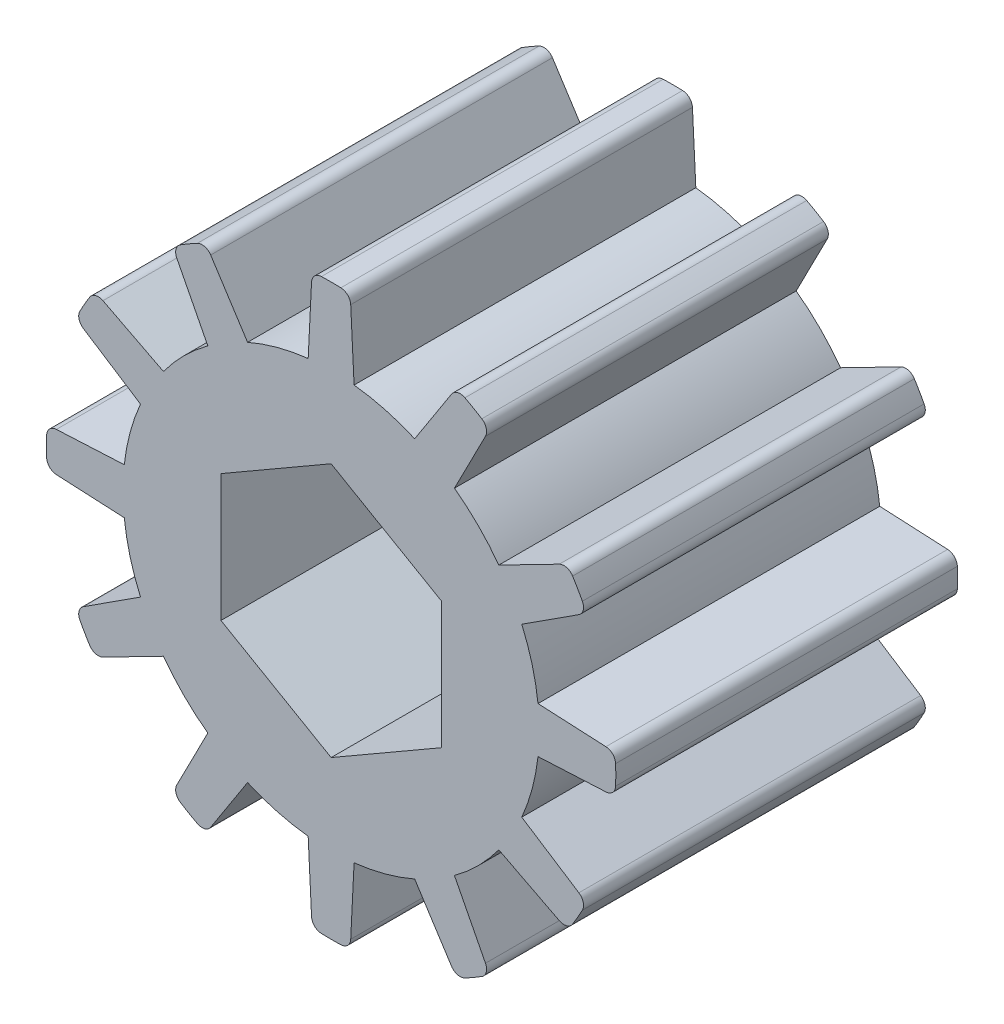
ISO-10303-21;
HEADER;
FILE_DESCRIPTION(('STEP AP214'),'2;1');
FILE_NAME('part.step','',(''),(''),'','','');
FILE_SCHEMA(('AUTOMOTIVE_DESIGN { 1 0 10303 214 1 1 1 1 }'));
ENDSEC;
DATA;
#1=APPLICATION_CONTEXT('core data for automotive mechanical design processes');
#2=APPLICATION_PROTOCOL_DEFINITION('international standard','automotive_design',2000,#1);
#3=PRODUCT_CONTEXT('',#1,'mechanical');
#4=PRODUCT('Part','Part','',(#3));
#5=PRODUCT_RELATED_PRODUCT_CATEGORY('part','',(#4));
#6=PRODUCT_DEFINITION_FORMATION('','',#4);
#7=PRODUCT_DEFINITION_CONTEXT('part definition',#1,'design');
#8=PRODUCT_DEFINITION('design','',#6,#7);
#9=PRODUCT_DEFINITION_SHAPE('','',#8);
#10=(LENGTH_UNIT() NAMED_UNIT(*) SI_UNIT(.MILLI.,.METRE.));
#11=(NAMED_UNIT(*) PLANE_ANGLE_UNIT() SI_UNIT($,.RADIAN.));
#12=(NAMED_UNIT(*) SI_UNIT($,.STERADIAN.) SOLID_ANGLE_UNIT());
#13=UNCERTAINTY_MEASURE_WITH_UNIT(LENGTH_MEASURE(1.E-05),#10,'distance_accuracy_value','');
#14=(GEOMETRIC_REPRESENTATION_CONTEXT(3) GLOBAL_UNCERTAINTY_ASSIGNED_CONTEXT((#13)) GLOBAL_UNIT_ASSIGNED_CONTEXT((#10,
#11,#12)) REPRESENTATION_CONTEXT('',''));
#15=CARTESIAN_POINT('',(0.,0.,0.));
#16=DIRECTION('',(0.,0.,1.));
#17=DIRECTION('',(1.,0.,0.));
#18=AXIS2_PLACEMENT_3D('',#15,#16,#17);
#19=CARTESIAN_POINT('',(0.,0.,6.7));
#20=DIRECTION('',(0.,0.,1.));
#21=DIRECTION('',(1.,0.,0.));
#22=AXIS2_PLACEMENT_3D('',#19,#20,#21);
#23=PLANE('',#22);
#24=DIRECTION('',(-0.866025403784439,-0.5,0.));
#25=VECTOR('',#24,1.);
#26=CARTESIAN_POINT('',(2.16,-1.24707658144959,6.7));
#27=LINE('',#26,#25);
#28=CARTESIAN_POINT('',(2.16,-1.24707658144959,6.7));
#29=VERTEX_POINT('',#28);
#30=CARTESIAN_POINT('',(0.,-2.49415316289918,6.7));
#31=VERTEX_POINT('',#30);
#32=EDGE_CURVE('E530',#29,#31,#27,.T.);
#33=ORIENTED_EDGE('',*,*,#32,.T.);
#34=DIRECTION('',(-0.866025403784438,0.5,0.));
#35=VECTOR('',#34,1.);
#36=CARTESIAN_POINT('',(0.,-2.49415316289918,6.7));
#37=LINE('',#36,#35);
#38=CARTESIAN_POINT('',(-2.16,-1.24707658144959,6.7));
#39=VERTEX_POINT('',#38);
#40=EDGE_CURVE('E543',#31,#39,#37,.T.);
#41=ORIENTED_EDGE('',*,*,#40,.T.);
#42=DIRECTION('',(0.,1.,0.));
#43=VECTOR('',#42,1.);
#44=CARTESIAN_POINT('',(-2.16,-1.24707658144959,6.7));
#45=LINE('',#44,#43);
#46=CARTESIAN_POINT('',(-2.16,1.24707658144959,6.7));
#47=VERTEX_POINT('',#46);
#48=EDGE_CURVE('E548',#39,#47,#45,.T.);
#49=ORIENTED_EDGE('',*,*,#48,.T.);
#50=DIRECTION('',(0.866025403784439,0.5,0.));
#51=VECTOR('',#50,1.);
#52=CARTESIAN_POINT('',(-2.16,1.24707658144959,6.7));
#53=LINE('',#52,#51);
#54=CARTESIAN_POINT('',(0.,2.49415316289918,6.7));
#55=VERTEX_POINT('',#54);
#56=EDGE_CURVE('E562',#47,#55,#53,.T.);
#57=ORIENTED_EDGE('',*,*,#56,.T.);
#58=DIRECTION('',(0.866025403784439,-0.5,0.));
#59=VECTOR('',#58,1.);
#60=CARTESIAN_POINT('',(0.,2.49415316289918,6.7));
#61=LINE('',#60,#59);
#62=CARTESIAN_POINT('',(2.16,1.24707658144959,6.7));
#63=VERTEX_POINT('',#62);
#64=EDGE_CURVE('E566',#55,#63,#61,.T.);
#65=ORIENTED_EDGE('',*,*,#64,.T.);
#66=DIRECTION('',(0.,-1.,0.));
#67=VECTOR('',#66,1.);
#68=CARTESIAN_POINT('',(2.16,1.24707658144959,6.7));
#69=LINE('',#68,#67);
#70=EDGE_CURVE('E539',#63,#29,#69,.T.);
#71=ORIENTED_EDGE('',*,*,#70,.T.);
#72=EDGE_LOOP('',(#33,#41,#49,#57,#65,#71));
#73=FACE_BOUND('',#72,.T.);
#74=DIRECTION('',(0.99877247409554,0.0495332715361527,0.));
#75=VECTOR('',#74,1.);
#76=CARTESIAN_POINT('',(5.56787554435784,-0.375,6.7));
#77=LINE('',#76,#75);
#78=CARTESIAN_POINT('',(4.0556003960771,-0.45,6.7));
#79=VERTEX_POINT('',#78);
#80=CARTESIAN_POINT('',(5.38724207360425,-0.383958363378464,6.7));
#81=VERTEX_POINT('',#80);
#82=EDGE_CURVE('E725',#79,#81,#77,.T.);
#83=ORIENTED_EDGE('',*,*,#82,.T.);
#84=CARTESIAN_POINT('',(5.37733541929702,-0.184203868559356,6.7));
#85=DIRECTION('',(0.,0.,1.));
#86=DIRECTION('',(1.,0.,0.));
#87=AXIS2_PLACEMENT_3D('',#84,#85,#86);
#88=CIRCLE('',#87,0.2);
#89=CARTESIAN_POINT('',(5.57721817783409,-0.191050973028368,6.7));
#90=VERTEX_POINT('',#89);
#91=EDGE_CURVE('E1180',#81,#90,#88,.T.);
#92=ORIENTED_EDGE('',*,*,#91,.T.);
#93=CARTESIAN_POINT('',(0.,0.,6.7));
#94=DIRECTION('',(0.,0.,1.));
#95=DIRECTION('',(1.,0.,0.));
#96=AXIS2_PLACEMENT_3D('',#93,#94,#95);
#97=CIRCLE('',#96,5.58048950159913);
#98=CARTESIAN_POINT('',(5.57721817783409,0.191050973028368,6.7));
#99=VERTEX_POINT('',#98);
#100=EDGE_CURVE('E729',#90,#99,#97,.T.);
#101=ORIENTED_EDGE('',*,*,#100,.T.);
#102=CARTESIAN_POINT('',(5.37733541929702,0.184203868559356,6.7));
#103=DIRECTION('',(0.,0.,1.));
#104=DIRECTION('',(1.,0.,0.));
#105=AXIS2_PLACEMENT_3D('',#102,#103,#104);
#106=CIRCLE('',#105,0.2);
#107=CARTESIAN_POINT('',(5.38724207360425,0.383958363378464,6.7));
#108=VERTEX_POINT('',#107);
#109=EDGE_CURVE('E1129',#99,#108,#106,.T.);
#110=ORIENTED_EDGE('',*,*,#109,.T.);
#111=DIRECTION('',(-0.99877247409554,0.0495332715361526,0.));
#112=VECTOR('',#111,1.);
#113=CARTESIAN_POINT('',(5.56787554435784,0.375,6.7));
#114=LINE('',#113,#112);
#115=CARTESIAN_POINT('',(4.0556003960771,0.45,6.7));
#116=VERTEX_POINT('',#115);
#117=EDGE_CURVE('E733',#108,#116,#114,.T.);
#118=ORIENTED_EDGE('',*,*,#117,.T.);
#119=CARTESIAN_POINT('',(0.,0.,6.7));
#120=DIRECTION('',(0.,0.,1.));
#121=DIRECTION('',(1.,0.,0.));
#122=AXIS2_PLACEMENT_3D('',#119,#120,#121);
#123=CIRCLE('',#122,4.08048950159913);
#124=CARTESIAN_POINT('',(3.737252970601,1.63808876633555,6.7));
#125=VERTEX_POINT('',#124);
#126=EDGE_CURVE('E736',#116,#125,#123,.T.);
#127=ORIENTED_EDGE('',*,*,#126,.T.);
#128=DIRECTION('',(0.840195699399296,0.542283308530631,0.));
#129=VECTOR('',#128,1.);
#130=CARTESIAN_POINT('',(5.009421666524,2.45917824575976,6.7));
#131=LINE('',#130,#129);
#132=CARTESIAN_POINT('',(4.85746767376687,2.36110334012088,6.7));
#133=VERTEX_POINT('',#132);
#134=EDGE_CURVE('E739',#125,#133,#131,.T.);
#135=ORIENTED_EDGE('',*,*,#134,.T.);
#136=CARTESIAN_POINT('',(4.74901101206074,2.52914248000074,6.7));
#137=DIRECTION('',(0.,0.,1.));
#138=DIRECTION('',(1.,0.,0.));
#139=AXIS2_PLACEMENT_3D('',#136,#137,#138);
#140=CIRCLE('',#139,0.2);
#141=CARTESIAN_POINT('',(4.92553811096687,2.62315409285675,6.7));
#142=VERTEX_POINT('',#141);
#143=EDGE_CURVE('E1126',#133,#142,#140,.T.);
#144=ORIENTED_EDGE('',*,*,#143,.T.);
#145=CARTESIAN_POINT('',(0.,0.,6.7));
#146=DIRECTION('',(0.,0.,1.));
#147=DIRECTION('',(1.,0.,0.));
#148=AXIS2_PLACEMENT_3D('',#145,#146,#147);
#149=CIRCLE('',#148,5.58048950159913);
#150=CARTESIAN_POINT('',(4.7344871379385,2.95406408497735,6.7));
#151=VERTEX_POINT('',#150);
#152=EDGE_CURVE('E743',#142,#151,#149,.T.);
#153=ORIENTED_EDGE('',*,*,#152,.T.);
#154=CARTESIAN_POINT('',(4.56480714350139,2.84819293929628,6.7));
#155=DIRECTION('',(0.,0.,1.));
#156=DIRECTION('',(1.,0.,0.));
#157=AXIS2_PLACEMENT_3D('',#154,#155,#156);
#158=CIRCLE('',#157,0.2);
#159=CARTESIAN_POINT('',(4.47350931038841,3.02613873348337,6.7));
#160=VERTEX_POINT('',#159);
#161=EDGE_CURVE('E1123',#151,#160,#158,.T.);
#162=ORIENTED_EDGE('',*,*,#161,.T.);
#163=DIRECTION('',(-0.889728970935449,-0.456489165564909,0.));
#164=VECTOR('',#163,1.);
#165=CARTESIAN_POINT('',(4.634421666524,3.10869729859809,6.7));
#166=LINE('',#165,#164);
#167=CARTESIAN_POINT('',(3.287252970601,2.41751162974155,6.7));
#168=VERTEX_POINT('',#167);
#169=EDGE_CURVE('E747',#160,#168,#166,.T.);
#170=ORIENTED_EDGE('',*,*,#169,.T.);
#171=CARTESIAN_POINT('',(0.,0.,6.7));
#172=DIRECTION('',(0.,0.,1.));
#173=DIRECTION('',(1.,0.,0.));
#174=AXIS2_PLACEMENT_3D('',#171,#172,#173);
#175=CIRCLE('',#174,4.08048950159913);
#176=CARTESIAN_POINT('',(2.41751162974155,3.287252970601,6.7));
#177=VERTEX_POINT('',#176);
#178=EDGE_CURVE('E750',#168,#177,#175,.T.);
#179=ORIENTED_EDGE('',*,*,#178,.T.);
#180=DIRECTION('',(0.456489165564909,0.889728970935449,0.));
#181=VECTOR('',#180,1.);
#182=CARTESIAN_POINT('',(3.10869729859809,4.634421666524,6.7));
#183=LINE('',#182,#181);
#184=CARTESIAN_POINT('',(3.02613873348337,4.47350931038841,6.7));
#185=VERTEX_POINT('',#184);
#186=EDGE_CURVE('E753',#177,#185,#183,.T.);
#187=ORIENTED_EDGE('',*,*,#186,.T.);
#188=CARTESIAN_POINT('',(2.84819293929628,4.56480714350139,6.7));
#189=DIRECTION('',(0.,0.,1.));
#190=DIRECTION('',(1.,0.,0.));
#191=AXIS2_PLACEMENT_3D('',#188,#189,#190);
#192=CIRCLE('',#191,0.2);
#193=CARTESIAN_POINT('',(2.95406408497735,4.7344871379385,6.7));
#194=VERTEX_POINT('',#193);
#195=EDGE_CURVE('E1120',#185,#194,#192,.T.);
#196=ORIENTED_EDGE('',*,*,#195,.T.);
#197=CARTESIAN_POINT('',(0.,0.,6.7));
#198=DIRECTION('',(0.,0.,1.));
#199=DIRECTION('',(1.,0.,0.));
#200=AXIS2_PLACEMENT_3D('',#197,#198,#199);
#201=CIRCLE('',#200,5.58048950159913);
#202=CARTESIAN_POINT('',(2.62315409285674,4.92553811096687,6.7));
#203=VERTEX_POINT('',#202);
#204=EDGE_CURVE('E757',#194,#203,#201,.T.);
#205=ORIENTED_EDGE('',*,*,#204,.T.);
#206=CARTESIAN_POINT('',(2.52914248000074,4.74901101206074,6.7));
#207=DIRECTION('',(0.,0.,1.));
#208=DIRECTION('',(1.,0.,0.));
#209=AXIS2_PLACEMENT_3D('',#206,#207,#208);
#210=CIRCLE('',#209,0.2);
#211=CARTESIAN_POINT('',(2.36110334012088,4.85746767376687,6.7));
#212=VERTEX_POINT('',#211);
#213=EDGE_CURVE('E61',#203,#212,#210,.T.);
#214=ORIENTED_EDGE('',*,*,#213,.T.);
#215=DIRECTION('',(-0.54228330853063,-0.840195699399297,0.));
#216=VECTOR('',#215,1.);
#217=CARTESIAN_POINT('',(2.45917824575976,5.009421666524,6.7));
#218=LINE('',#217,#216);
#219=CARTESIAN_POINT('',(1.63808876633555,3.737252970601,6.7));
#220=VERTEX_POINT('',#219);
#221=EDGE_CURVE('E760',#212,#220,#218,.T.);
#222=ORIENTED_EDGE('',*,*,#221,.T.);
#223=CARTESIAN_POINT('',(0.,0.,6.7));
#224=DIRECTION('',(0.,0.,1.));
#225=DIRECTION('',(1.,0.,0.));
#226=AXIS2_PLACEMENT_3D('',#223,#224,#225);
#227=CIRCLE('',#226,4.08048950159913);
#228=CARTESIAN_POINT('',(0.45,4.0556003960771,6.7));
#229=VERTEX_POINT('',#228);
#230=EDGE_CURVE('E763',#220,#229,#227,.T.);
#231=ORIENTED_EDGE('',*,*,#230,.T.);
#232=DIRECTION('',(-0.0495332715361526,0.99877247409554,0.));
#233=VECTOR('',#232,1.);
#234=CARTESIAN_POINT('',(0.375,5.56787554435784,6.7));
#235=LINE('',#234,#233);
#236=CARTESIAN_POINT('',(0.383958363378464,5.38724207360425,6.7));
#237=VERTEX_POINT('',#236);
#238=EDGE_CURVE('E766',#229,#237,#235,.T.);
#239=ORIENTED_EDGE('',*,*,#238,.T.);
#240=CARTESIAN_POINT('',(0.184203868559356,5.37733541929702,6.7));
#241=DIRECTION('',(0.,0.,1.));
#242=DIRECTION('',(1.,0.,0.));
#243=AXIS2_PLACEMENT_3D('',#240,#241,#242);
#244=CIRCLE('',#243,0.2);
#245=CARTESIAN_POINT('',(0.191050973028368,5.57721817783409,6.7));
#246=VERTEX_POINT('',#245);
#247=EDGE_CURVE('E1115',#237,#246,#244,.T.);
#248=ORIENTED_EDGE('',*,*,#247,.T.);
#249=CARTESIAN_POINT('',(0.,0.,6.7));
#250=DIRECTION('',(0.,0.,1.));
#251=DIRECTION('',(1.,0.,0.));
#252=AXIS2_PLACEMENT_3D('',#249,#250,#251);
#253=CIRCLE('',#252,5.58048950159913);
#254=CARTESIAN_POINT('',(-0.191050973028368,5.57721817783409,6.7));
#255=VERTEX_POINT('',#254);
#256=EDGE_CURVE('E602',#246,#255,#253,.T.);
#257=ORIENTED_EDGE('',*,*,#256,.T.);
#258=CARTESIAN_POINT('',(-0.184203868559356,5.37733541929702,6.7));
#259=DIRECTION('',(0.,0.,1.));
#260=DIRECTION('',(1.,0.,0.));
#261=AXIS2_PLACEMENT_3D('',#258,#259,#260);
#262=CIRCLE('',#261,0.2);
#263=CARTESIAN_POINT('',(-0.383958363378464,5.38724207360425,6.7));
#264=VERTEX_POINT('',#263);
#265=EDGE_CURVE('E1112',#255,#264,#262,.T.);
#266=ORIENTED_EDGE('',*,*,#265,.T.);
#267=DIRECTION('',(-0.0495332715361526,-0.99877247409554,0.));
#268=VECTOR('',#267,1.);
#269=CARTESIAN_POINT('',(-0.375,5.56787554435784,6.7));
#270=LINE('',#269,#268);
#271=CARTESIAN_POINT('',(-0.45,4.0556003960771,6.7));
#272=VERTEX_POINT('',#271);
#273=EDGE_CURVE('E606',#264,#272,#270,.T.);
#274=ORIENTED_EDGE('',*,*,#273,.T.);
#275=CARTESIAN_POINT('',(0.,0.,6.7));
#276=DIRECTION('',(0.,0.,1.));
#277=DIRECTION('',(1.,0.,0.));
#278=AXIS2_PLACEMENT_3D('',#275,#276,#277);
#279=CIRCLE('',#278,4.08048950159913);
#280=CARTESIAN_POINT('',(-1.63808876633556,3.737252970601,6.7));
#281=VERTEX_POINT('',#280);
#282=EDGE_CURVE('E610',#272,#281,#279,.T.);
#283=ORIENTED_EDGE('',*,*,#282,.T.);
#284=DIRECTION('',(-0.542283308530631,0.840195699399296,0.));
#285=VECTOR('',#284,1.);
#286=CARTESIAN_POINT('',(-2.45917824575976,5.009421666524,6.7));
#287=LINE('',#286,#285);
#288=CARTESIAN_POINT('',(-2.36110334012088,4.85746767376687,6.7));
#289=VERTEX_POINT('',#288);
#290=EDGE_CURVE('E613',#281,#289,#287,.T.);
#291=ORIENTED_EDGE('',*,*,#290,.T.);
#292=CARTESIAN_POINT('',(-2.52914248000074,4.74901101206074,6.7));
#293=DIRECTION('',(0.,0.,1.));
#294=DIRECTION('',(1.,0.,0.));
#295=AXIS2_PLACEMENT_3D('',#292,#293,#294);
#296=CIRCLE('',#295,0.2);
#297=CARTESIAN_POINT('',(-2.62315409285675,4.92553811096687,6.7));
#298=VERTEX_POINT('',#297);
#299=EDGE_CURVE('E1132',#289,#298,#296,.T.);
#300=ORIENTED_EDGE('',*,*,#299,.T.);
#301=CARTESIAN_POINT('',(0.,0.,6.7));
#302=DIRECTION('',(0.,0.,1.));
#303=DIRECTION('',(1.,0.,0.));
#304=AXIS2_PLACEMENT_3D('',#301,#302,#303);
#305=CIRCLE('',#304,5.58048950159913);
#306=CARTESIAN_POINT('',(-2.95406408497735,4.7344871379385,6.7));
#307=VERTEX_POINT('',#306);
#308=EDGE_CURVE('E617',#298,#307,#305,.T.);
#309=ORIENTED_EDGE('',*,*,#308,.T.);
#310=CARTESIAN_POINT('',(-2.84819293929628,4.56480714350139,6.7));
#311=DIRECTION('',(0.,0.,1.));
#312=DIRECTION('',(1.,0.,0.));
#313=AXIS2_PLACEMENT_3D('',#310,#311,#312);
#314=CIRCLE('',#313,0.2);
#315=CARTESIAN_POINT('',(-3.02613873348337,4.47350931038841,6.7));
#316=VERTEX_POINT('',#315);
#317=EDGE_CURVE('E1135',#307,#316,#314,.T.);
#318=ORIENTED_EDGE('',*,*,#317,.T.);
#319=DIRECTION('',(0.456489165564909,-0.889728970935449,0.));
#320=VECTOR('',#319,1.);
#321=CARTESIAN_POINT('',(-3.10869729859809,4.634421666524,6.7));
#322=LINE('',#321,#320);
#323=CARTESIAN_POINT('',(-2.41751162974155,3.287252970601,6.7));
#324=VERTEX_POINT('',#323);
#325=EDGE_CURVE('E621',#316,#324,#322,.T.);
#326=ORIENTED_EDGE('',*,*,#325,.T.);
#327=CARTESIAN_POINT('',(0.,0.,6.7));
#328=DIRECTION('',(0.,0.,1.));
#329=DIRECTION('',(1.,0.,0.));
#330=AXIS2_PLACEMENT_3D('',#327,#328,#329);
#331=CIRCLE('',#330,4.08048950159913);
#332=CARTESIAN_POINT('',(-3.287252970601,2.41751162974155,6.7));
#333=VERTEX_POINT('',#332);
#334=EDGE_CURVE('E624',#324,#333,#331,.T.);
#335=ORIENTED_EDGE('',*,*,#334,.T.);
#336=DIRECTION('',(-0.889728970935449,0.456489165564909,0.));
#337=VECTOR('',#336,1.);
#338=CARTESIAN_POINT('',(-4.634421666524,3.10869729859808,6.7));
#339=LINE('',#338,#337);
#340=CARTESIAN_POINT('',(-4.47350931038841,3.02613873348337,6.7));
#341=VERTEX_POINT('',#340);
#342=EDGE_CURVE('E627',#333,#341,#339,.T.);
#343=ORIENTED_EDGE('',*,*,#342,.T.);
#344=CARTESIAN_POINT('',(-4.56480714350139,2.84819293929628,6.7));
#345=DIRECTION('',(0.,0.,1.));
#346=DIRECTION('',(1.,0.,0.));
#347=AXIS2_PLACEMENT_3D('',#344,#345,#346);
#348=CIRCLE('',#347,0.2);
#349=CARTESIAN_POINT('',(-4.7344871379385,2.95406408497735,6.7));
#350=VERTEX_POINT('',#349);
#351=EDGE_CURVE('E1138',#341,#350,#348,.T.);
#352=ORIENTED_EDGE('',*,*,#351,.T.);
#353=CARTESIAN_POINT('',(0.,0.,6.7));
#354=DIRECTION('',(0.,0.,1.));
#355=DIRECTION('',(1.,0.,0.));
#356=AXIS2_PLACEMENT_3D('',#353,#354,#355);
#357=CIRCLE('',#356,5.58048950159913);
#358=CARTESIAN_POINT('',(-4.92553811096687,2.62315409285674,6.7));
#359=VERTEX_POINT('',#358);
#360=EDGE_CURVE('E631',#350,#359,#357,.T.);
#361=ORIENTED_EDGE('',*,*,#360,.T.);
#362=CARTESIAN_POINT('',(-4.74901101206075,2.52914248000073,6.7));
#363=DIRECTION('',(0.,0.,1.));
#364=DIRECTION('',(1.,0.,0.));
#365=AXIS2_PLACEMENT_3D('',#362,#363,#364);
#366=CIRCLE('',#365,0.2);
#367=CARTESIAN_POINT('',(-4.85746767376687,2.36110334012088,6.7));
#368=VERTEX_POINT('',#367);
#369=EDGE_CURVE('E1141',#359,#368,#366,.T.);
#370=ORIENTED_EDGE('',*,*,#369,.T.);
#371=DIRECTION('',(0.840195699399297,-0.54228330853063,0.));
#372=VECTOR('',#371,1.);
#373=CARTESIAN_POINT('',(-5.009421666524,2.45917824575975,6.7));
#374=LINE('',#373,#372);
#375=CARTESIAN_POINT('',(-3.737252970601,1.63808876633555,6.7));
#376=VERTEX_POINT('',#375);
#377=EDGE_CURVE('E635',#368,#376,#374,.T.);
#378=ORIENTED_EDGE('',*,*,#377,.T.);
#379=CARTESIAN_POINT('',(0.,0.,6.7));
#380=DIRECTION('',(0.,0.,1.));
#381=DIRECTION('',(1.,0.,0.));
#382=AXIS2_PLACEMENT_3D('',#379,#380,#381);
#383=CIRCLE('',#382,4.08048950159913);
#384=CARTESIAN_POINT('',(-4.0556003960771,0.449999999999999,6.7));
#385=VERTEX_POINT('',#384);
#386=EDGE_CURVE('E638',#376,#385,#383,.T.);
#387=ORIENTED_EDGE('',*,*,#386,.T.);
#388=DIRECTION('',(-0.99877247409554,-0.0495332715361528,0.));
#389=VECTOR('',#388,1.);
#390=CARTESIAN_POINT('',(-5.56787554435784,0.374999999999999,6.7));
#391=LINE('',#390,#389);
#392=CARTESIAN_POINT('',(-5.38724207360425,0.383958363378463,6.7));
#393=VERTEX_POINT('',#392);
#394=EDGE_CURVE('E641',#385,#393,#391,.T.);
#395=ORIENTED_EDGE('',*,*,#394,.T.);
#396=CARTESIAN_POINT('',(-5.37733541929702,0.184203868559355,6.7));
#397=DIRECTION('',(0.,0.,1.));
#398=DIRECTION('',(1.,0.,0.));
#399=AXIS2_PLACEMENT_3D('',#396,#397,#398);
#400=CIRCLE('',#399,0.2);
#401=CARTESIAN_POINT('',(-5.57721817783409,0.191050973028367,6.7));
#402=VERTEX_POINT('',#401);
#403=EDGE_CURVE('E1144',#393,#402,#400,.T.);
#404=ORIENTED_EDGE('',*,*,#403,.T.);
#405=CARTESIAN_POINT('',(0.,0.,6.7));
#406=DIRECTION('',(0.,0.,1.));
#407=DIRECTION('',(1.,0.,0.));
#408=AXIS2_PLACEMENT_3D('',#405,#406,#407);
#409=CIRCLE('',#408,5.58048950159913);
#410=CARTESIAN_POINT('',(-5.57721817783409,-0.191050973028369,6.7));
#411=VERTEX_POINT('',#410);
#412=EDGE_CURVE('E645',#402,#411,#409,.T.);
#413=ORIENTED_EDGE('',*,*,#412,.T.);
#414=CARTESIAN_POINT('',(-5.37733541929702,-0.184203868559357,6.7));
#415=DIRECTION('',(0.,0.,1.));
#416=DIRECTION('',(1.,0.,0.));
#417=AXIS2_PLACEMENT_3D('',#414,#415,#416);
#418=CIRCLE('',#417,0.2);
#419=CARTESIAN_POINT('',(-5.38724207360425,-0.383958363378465,6.7));
#420=VERTEX_POINT('',#419);
#421=EDGE_CURVE('E1147',#411,#420,#418,.T.);
#422=ORIENTED_EDGE('',*,*,#421,.T.);
#423=DIRECTION('',(0.99877247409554,-0.0495332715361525,0.));
#424=VECTOR('',#423,1.);
#425=CARTESIAN_POINT('',(-5.56787554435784,-0.375000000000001,6.7));
#426=LINE('',#425,#424);
#427=CARTESIAN_POINT('',(-4.0556003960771,-0.449999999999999,6.7));
#428=VERTEX_POINT('',#427);
#429=EDGE_CURVE('E649',#420,#428,#426,.T.);
#430=ORIENTED_EDGE('',*,*,#429,.T.);
#431=CARTESIAN_POINT('',(0.,0.,6.7));
#432=DIRECTION('',(0.,0.,1.));
#433=DIRECTION('',(1.,0.,0.));
#434=AXIS2_PLACEMENT_3D('',#431,#432,#433);
#435=CIRCLE('',#434,4.08048950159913);
#436=CARTESIAN_POINT('',(-3.737252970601,-1.63808876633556,6.7));
#437=VERTEX_POINT('',#436);
#438=EDGE_CURVE('E652',#428,#437,#435,.T.);
#439=ORIENTED_EDGE('',*,*,#438,.T.);
#440=DIRECTION('',(-0.840195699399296,-0.542283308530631,0.));
#441=VECTOR('',#440,1.);
#442=CARTESIAN_POINT('',(-5.009421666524,-2.45917824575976,6.7));
#443=LINE('',#442,#441);
#444=CARTESIAN_POINT('',(-4.85746767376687,-2.36110334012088,6.7));
#445=VERTEX_POINT('',#444);
#446=EDGE_CURVE('E655',#437,#445,#443,.T.);
#447=ORIENTED_EDGE('',*,*,#446,.T.);
#448=CARTESIAN_POINT('',(-4.74901101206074,-2.52914248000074,6.7));
#449=DIRECTION('',(0.,0.,1.));
#450=DIRECTION('',(1.,0.,0.));
#451=AXIS2_PLACEMENT_3D('',#448,#449,#450);
#452=CIRCLE('',#451,0.2);
#453=CARTESIAN_POINT('',(-4.92553811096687,-2.62315409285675,6.7));
#454=VERTEX_POINT('',#453);
#455=EDGE_CURVE('E1150',#445,#454,#452,.T.);
#456=ORIENTED_EDGE('',*,*,#455,.T.);
#457=CARTESIAN_POINT('',(0.,0.,6.7));
#458=DIRECTION('',(0.,0.,1.));
#459=DIRECTION('',(1.,0.,0.));
#460=AXIS2_PLACEMENT_3D('',#457,#458,#459);
#461=CIRCLE('',#460,5.58048950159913);
#462=CARTESIAN_POINT('',(-4.7344871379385,-2.95406408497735,6.7));
#463=VERTEX_POINT('',#462);
#464=EDGE_CURVE('E659',#454,#463,#461,.T.);
#465=ORIENTED_EDGE('',*,*,#464,.T.);
#466=CARTESIAN_POINT('',(-4.56480714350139,-2.84819293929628,6.7));
#467=DIRECTION('',(0.,0.,1.));
#468=DIRECTION('',(1.,0.,0.));
#469=AXIS2_PLACEMENT_3D('',#466,#467,#468);
#470=CIRCLE('',#469,0.2);
#471=CARTESIAN_POINT('',(-4.4735093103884,-3.02613873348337,6.7));
#472=VERTEX_POINT('',#471);
#473=EDGE_CURVE('E1153',#463,#472,#470,.T.);
#474=ORIENTED_EDGE('',*,*,#473,.T.);
#475=DIRECTION('',(0.889728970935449,0.456489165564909,0.));
#476=VECTOR('',#475,1.);
#477=CARTESIAN_POINT('',(-4.634421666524,-3.10869729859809,6.7));
#478=LINE('',#477,#476);
#479=CARTESIAN_POINT('',(-3.287252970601,-2.41751162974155,6.7));
#480=VERTEX_POINT('',#479);
#481=EDGE_CURVE('E663',#472,#480,#478,.T.);
#482=ORIENTED_EDGE('',*,*,#481,.T.);
#483=CARTESIAN_POINT('',(0.,0.,6.7));
#484=DIRECTION('',(0.,0.,1.));
#485=DIRECTION('',(1.,0.,0.));
#486=AXIS2_PLACEMENT_3D('',#483,#484,#485);
#487=CIRCLE('',#486,4.08048950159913);
#488=CARTESIAN_POINT('',(-2.41751162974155,-3.287252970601,6.7));
#489=VERTEX_POINT('',#488);
#490=EDGE_CURVE('E666',#480,#489,#487,.T.);
#491=ORIENTED_EDGE('',*,*,#490,.T.);
#492=DIRECTION('',(-0.456489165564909,-0.889728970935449,0.));
#493=VECTOR('',#492,1.);
#494=CARTESIAN_POINT('',(-3.10869729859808,-4.634421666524,6.7));
#495=LINE('',#494,#493);
#496=CARTESIAN_POINT('',(-3.02613873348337,-4.47350931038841,6.7));
#497=VERTEX_POINT('',#496);
#498=EDGE_CURVE('E669',#489,#497,#495,.T.);
#499=ORIENTED_EDGE('',*,*,#498,.T.);
#500=CARTESIAN_POINT('',(-2.84819293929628,-4.56480714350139,6.7));
#501=DIRECTION('',(0.,0.,1.));
#502=DIRECTION('',(1.,0.,0.));
#503=AXIS2_PLACEMENT_3D('',#500,#501,#502);
#504=CIRCLE('',#503,0.2);
#505=CARTESIAN_POINT('',(-2.95406408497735,-4.7344871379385,6.7));
#506=VERTEX_POINT('',#505);
#507=EDGE_CURVE('E1174',#497,#506,#504,.T.);
#508=ORIENTED_EDGE('',*,*,#507,.T.);
#509=CARTESIAN_POINT('',(0.,0.,6.7));
#510=DIRECTION('',(0.,0.,1.));
#511=DIRECTION('',(1.,0.,0.));
#512=AXIS2_PLACEMENT_3D('',#509,#510,#511);
#513=CIRCLE('',#512,5.58048950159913);
#514=CARTESIAN_POINT('',(-2.62315409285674,-4.92553811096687,6.7));
#515=VERTEX_POINT('',#514);
#516=EDGE_CURVE('E673',#506,#515,#513,.T.);
#517=ORIENTED_EDGE('',*,*,#516,.T.);
#518=CARTESIAN_POINT('',(-2.52914248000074,-4.74901101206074,6.7));
#519=DIRECTION('',(0.,0.,1.));
#520=DIRECTION('',(1.,0.,0.));
#521=AXIS2_PLACEMENT_3D('',#518,#519,#520);
#522=CIRCLE('',#521,0.2);
#523=CARTESIAN_POINT('',(-2.36110334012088,-4.85746767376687,6.7));
#524=VERTEX_POINT('',#523);
#525=EDGE_CURVE('E1177',#515,#524,#522,.T.);
#526=ORIENTED_EDGE('',*,*,#525,.T.);
#527=DIRECTION('',(0.542283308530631,0.840195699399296,0.));
#528=VECTOR('',#527,1.);
#529=CARTESIAN_POINT('',(-2.45917824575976,-5.009421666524,6.7));
#530=LINE('',#529,#528);
#531=CARTESIAN_POINT('',(-1.63808876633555,-3.737252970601,6.7));
#532=VERTEX_POINT('',#531);
#533=EDGE_CURVE('E677',#524,#532,#530,.T.);
#534=ORIENTED_EDGE('',*,*,#533,.T.);
#535=CARTESIAN_POINT('',(0.,0.,6.7));
#536=DIRECTION('',(0.,0.,1.));
#537=DIRECTION('',(1.,0.,0.));
#538=AXIS2_PLACEMENT_3D('',#535,#536,#537);
#539=CIRCLE('',#538,4.08048950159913);
#540=CARTESIAN_POINT('',(-0.45,-4.0556003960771,6.7));
#541=VERTEX_POINT('',#540);
#542=EDGE_CURVE('E680',#532,#541,#539,.T.);
#543=ORIENTED_EDGE('',*,*,#542,.T.);
#544=DIRECTION('',(0.0495332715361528,-0.99877247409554,0.));
#545=VECTOR('',#544,1.);
#546=CARTESIAN_POINT('',(-0.374999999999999,-5.56787554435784,6.7));
#547=LINE('',#546,#545);
#548=CARTESIAN_POINT('',(-0.383958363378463,-5.38724207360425,6.7));
#549=VERTEX_POINT('',#548);
#550=EDGE_CURVE('E683',#541,#549,#547,.T.);
#551=ORIENTED_EDGE('',*,*,#550,.T.);
#552=CARTESIAN_POINT('',(-0.184203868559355,-5.37733541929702,6.7));
#553=DIRECTION('',(0.,0.,1.));
#554=DIRECTION('',(1.,0.,0.));
#555=AXIS2_PLACEMENT_3D('',#552,#553,#554);
#556=CIRCLE('',#555,0.2);
#557=CARTESIAN_POINT('',(-0.191050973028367,-5.57721817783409,6.7));
#558=VERTEX_POINT('',#557);
#559=EDGE_CURVE('E1168',#549,#558,#556,.T.);
#560=ORIENTED_EDGE('',*,*,#559,.T.);
#561=CARTESIAN_POINT('',(0.,0.,6.7));
#562=DIRECTION('',(0.,0.,1.));
#563=DIRECTION('',(1.,0.,0.));
#564=AXIS2_PLACEMENT_3D('',#561,#562,#563);
#565=CIRCLE('',#564,5.58048950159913);
#566=CARTESIAN_POINT('',(0.191050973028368,-5.57721817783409,6.7));
#567=VERTEX_POINT('',#566);
#568=EDGE_CURVE('E687',#558,#567,#565,.T.);
#569=ORIENTED_EDGE('',*,*,#568,.T.);
#570=CARTESIAN_POINT('',(0.184203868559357,-5.37733541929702,6.7));
#571=DIRECTION('',(0.,0.,1.));
#572=DIRECTION('',(1.,0.,0.));
#573=AXIS2_PLACEMENT_3D('',#570,#571,#572);
#574=CIRCLE('',#573,0.2);
#575=CARTESIAN_POINT('',(0.383958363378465,-5.38724207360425,6.7));
#576=VERTEX_POINT('',#575);
#577=EDGE_CURVE('E1171',#567,#576,#574,.T.);
#578=ORIENTED_EDGE('',*,*,#577,.T.);
#579=DIRECTION('',(0.0495332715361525,0.99877247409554,0.));
#580=VECTOR('',#579,1.);
#581=CARTESIAN_POINT('',(0.375000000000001,-5.56787554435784,6.7));
#582=LINE('',#581,#580);
#583=CARTESIAN_POINT('',(0.449999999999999,-4.0556003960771,6.7));
#584=VERTEX_POINT('',#583);
#585=EDGE_CURVE('E691',#576,#584,#582,.T.);
#586=ORIENTED_EDGE('',*,*,#585,.T.);
#587=CARTESIAN_POINT('',(0.,0.,6.7));
#588=DIRECTION('',(0.,0.,1.));
#589=DIRECTION('',(1.,0.,0.));
#590=AXIS2_PLACEMENT_3D('',#587,#588,#589);
#591=CIRCLE('',#590,4.08048950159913);
#592=CARTESIAN_POINT('',(1.63808876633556,-3.737252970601,6.7));
#593=VERTEX_POINT('',#592);
#594=EDGE_CURVE('E694',#584,#593,#591,.T.);
#595=ORIENTED_EDGE('',*,*,#594,.T.);
#596=DIRECTION('',(0.542283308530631,-0.840195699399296,0.));
#597=VECTOR('',#596,1.);
#598=CARTESIAN_POINT('',(2.45917824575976,-5.009421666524,6.7));
#599=LINE('',#598,#597);
#600=CARTESIAN_POINT('',(2.36110334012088,-4.85746767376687,6.7));
#601=VERTEX_POINT('',#600);
#602=EDGE_CURVE('E697',#593,#601,#599,.T.);
#603=ORIENTED_EDGE('',*,*,#602,.T.);
#604=CARTESIAN_POINT('',(2.52914248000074,-4.74901101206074,6.7));
#605=DIRECTION('',(0.,0.,1.));
#606=DIRECTION('',(1.,0.,0.));
#607=AXIS2_PLACEMENT_3D('',#604,#605,#606);
#608=CIRCLE('',#607,0.2);
#609=CARTESIAN_POINT('',(2.62315409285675,-4.92553811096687,6.7));
#610=VERTEX_POINT('',#609);
#611=EDGE_CURVE('E1162',#601,#610,#608,.T.);
#612=ORIENTED_EDGE('',*,*,#611,.T.);
#613=CARTESIAN_POINT('',(0.,0.,6.7));
#614=DIRECTION('',(0.,0.,1.));
#615=DIRECTION('',(1.,0.,0.));
#616=AXIS2_PLACEMENT_3D('',#613,#614,#615);
#617=CIRCLE('',#616,5.58048950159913);
#618=CARTESIAN_POINT('',(2.95406408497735,-4.7344871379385,6.7));
#619=VERTEX_POINT('',#618);
#620=EDGE_CURVE('E701',#610,#619,#617,.T.);
#621=ORIENTED_EDGE('',*,*,#620,.T.);
#622=CARTESIAN_POINT('',(2.84819293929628,-4.56480714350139,6.7));
#623=DIRECTION('',(0.,0.,1.));
#624=DIRECTION('',(1.,0.,0.));
#625=AXIS2_PLACEMENT_3D('',#622,#623,#624);
#626=CIRCLE('',#625,0.2);
#627=CARTESIAN_POINT('',(3.02613873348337,-4.47350931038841,6.7));
#628=VERTEX_POINT('',#627);
#629=EDGE_CURVE('E1165',#619,#628,#626,.T.);
#630=ORIENTED_EDGE('',*,*,#629,.T.);
#631=DIRECTION('',(-0.456489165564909,0.889728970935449,0.));
#632=VECTOR('',#631,1.);
#633=CARTESIAN_POINT('',(3.10869729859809,-4.634421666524,6.7));
#634=LINE('',#633,#632);
#635=CARTESIAN_POINT('',(2.41751162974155,-3.287252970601,6.7));
#636=VERTEX_POINT('',#635);
#637=EDGE_CURVE('E705',#628,#636,#634,.T.);
#638=ORIENTED_EDGE('',*,*,#637,.T.);
#639=CARTESIAN_POINT('',(0.,0.,6.7));
#640=DIRECTION('',(0.,0.,1.));
#641=DIRECTION('',(1.,0.,0.));
#642=AXIS2_PLACEMENT_3D('',#639,#640,#641);
#643=CIRCLE('',#642,4.08048950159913);
#644=CARTESIAN_POINT('',(3.287252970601,-2.41751162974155,6.7));
#645=VERTEX_POINT('',#644);
#646=EDGE_CURVE('E708',#636,#645,#643,.T.);
#647=ORIENTED_EDGE('',*,*,#646,.T.);
#648=DIRECTION('',(0.889728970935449,-0.456489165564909,0.));
#649=VECTOR('',#648,1.);
#650=CARTESIAN_POINT('',(4.634421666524,-3.10869729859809,6.7));
#651=LINE('',#650,#649);
#652=CARTESIAN_POINT('',(4.47350931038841,-3.02613873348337,6.7));
#653=VERTEX_POINT('',#652);
#654=EDGE_CURVE('E711',#645,#653,#651,.T.);
#655=ORIENTED_EDGE('',*,*,#654,.T.);
#656=CARTESIAN_POINT('',(4.56480714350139,-2.84819293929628,6.7));
#657=DIRECTION('',(0.,0.,1.));
#658=DIRECTION('',(1.,0.,0.));
#659=AXIS2_PLACEMENT_3D('',#656,#657,#658);
#660=CIRCLE('',#659,0.2);
#661=CARTESIAN_POINT('',(4.7344871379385,-2.95406408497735,6.7));
#662=VERTEX_POINT('',#661);
#663=EDGE_CURVE('E1156',#653,#662,#660,.T.);
#664=ORIENTED_EDGE('',*,*,#663,.T.);
#665=CARTESIAN_POINT('',(0.,0.,6.7));
#666=DIRECTION('',(0.,0.,1.));
#667=DIRECTION('',(1.,0.,0.));
#668=AXIS2_PLACEMENT_3D('',#665,#666,#667);
#669=CIRCLE('',#668,5.58048950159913);
#670=CARTESIAN_POINT('',(4.92553811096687,-2.62315409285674,6.7));
#671=VERTEX_POINT('',#670);
#672=EDGE_CURVE('E715',#662,#671,#669,.T.);
#673=ORIENTED_EDGE('',*,*,#672,.T.);
#674=CARTESIAN_POINT('',(4.74901101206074,-2.52914248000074,6.7));
#675=DIRECTION('',(0.,0.,1.));
#676=DIRECTION('',(1.,0.,0.));
#677=AXIS2_PLACEMENT_3D('',#674,#675,#676);
#678=CIRCLE('',#677,0.2);
#679=CARTESIAN_POINT('',(4.85746767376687,-2.36110334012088,6.7));
#680=VERTEX_POINT('',#679);
#681=EDGE_CURVE('E1159',#671,#680,#678,.T.);
#682=ORIENTED_EDGE('',*,*,#681,.T.);
#683=DIRECTION('',(-0.840195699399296,0.542283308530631,0.));
#684=VECTOR('',#683,1.);
#685=CARTESIAN_POINT('',(5.009421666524,-2.45917824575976,6.7));
#686=LINE('',#685,#684);
#687=CARTESIAN_POINT('',(3.737252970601,-1.63808876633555,6.7));
#688=VERTEX_POINT('',#687);
#689=EDGE_CURVE('E719',#680,#688,#686,.T.);
#690=ORIENTED_EDGE('',*,*,#689,.T.);
#691=CARTESIAN_POINT('',(0.,0.,6.7));
#692=DIRECTION('',(0.,0.,1.));
#693=DIRECTION('',(1.,0.,0.));
#694=AXIS2_PLACEMENT_3D('',#691,#692,#693);
#695=CIRCLE('',#694,4.08048950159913);
#696=EDGE_CURVE('E722',#688,#79,#695,.T.);
#697=ORIENTED_EDGE('',*,*,#696,.T.);
#698=EDGE_LOOP('',(#83,#92,#101,#110,#118,#127,#135,#144,#153,#162,#170,#179,#187,#196,#205,
#214,#222,#231,#239,#248,#257,#266,#274,#283,#291,#300,#309,#318,#326,#335,#343,#352,#361,#370,
#378,#387,#395,#404,#413,#422,#430,#439,#447,#456,#465,#474,#482,#491,#499,#508,#517,#526,#534,
#543,#551,#560,#569,#578,#586,#595,#603,#612,#621,#630,#638,#647,#655,#664,#673,#682,#690,#697));
#699=FACE_BOUND('',#698,.T.);
#700=ADVANCED_FACE('F38',(#73,#699),#23,.T.);
#701=CARTESIAN_POINT('',(0.,0.,0.));
#702=DIRECTION('',(0.,0.,1.));
#703=DIRECTION('',(1.,0.,0.));
#704=AXIS2_PLACEMENT_3D('',#701,#702,#703);
#705=PLANE('',#704);
#706=DIRECTION('',(-0.866025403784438,0.5,0.));
#707=VECTOR('',#706,1.);
#708=CARTESIAN_POINT('',(0.,-2.49415316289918,0.));
#709=LINE('',#708,#707);
#710=CARTESIAN_POINT('',(0.,-2.49415316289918,0.));
#711=VERTEX_POINT('',#710);
#712=CARTESIAN_POINT('',(-2.16,-1.24707658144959,0.));
#713=VERTEX_POINT('',#712);
#714=EDGE_CURVE('E573',#711,#713,#709,.T.);
#715=ORIENTED_EDGE('',*,*,#714,.F.);
#716=DIRECTION('',(-0.866025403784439,-0.5,0.));
#717=VECTOR('',#716,1.);
#718=CARTESIAN_POINT('',(2.16,-1.24707658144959,0.));
#719=LINE('',#718,#717);
#720=CARTESIAN_POINT('',(2.16,-1.24707658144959,0.));
#721=VERTEX_POINT('',#720);
#722=EDGE_CURVE('E533',#721,#711,#719,.T.);
#723=ORIENTED_EDGE('',*,*,#722,.F.);
#724=DIRECTION('',(0.,-1.,0.));
#725=VECTOR('',#724,1.);
#726=CARTESIAN_POINT('',(2.16,1.24707658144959,0.));
#727=LINE('',#726,#725);
#728=CARTESIAN_POINT('',(2.16,1.24707658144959,0.));
#729=VERTEX_POINT('',#728);
#730=EDGE_CURVE('E553',#729,#721,#727,.T.);
#731=ORIENTED_EDGE('',*,*,#730,.F.);
#732=DIRECTION('',(0.866025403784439,-0.5,0.));
#733=VECTOR('',#732,1.);
#734=CARTESIAN_POINT('',(0.,2.49415316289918,0.));
#735=LINE('',#734,#733);
#736=CARTESIAN_POINT('',(0.,2.49415316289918,0.));
#737=VERTEX_POINT('',#736);
#738=EDGE_CURVE('E557',#737,#729,#735,.T.);
#739=ORIENTED_EDGE('',*,*,#738,.F.);
#740=DIRECTION('',(0.866025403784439,0.5,0.));
#741=VECTOR('',#740,1.);
#742=CARTESIAN_POINT('',(-2.16,1.24707658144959,0.));
#743=LINE('',#742,#741);
#744=CARTESIAN_POINT('',(-2.16,1.24707658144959,0.));
#745=VERTEX_POINT('',#744);
#746=EDGE_CURVE('E580',#745,#737,#743,.T.);
#747=ORIENTED_EDGE('',*,*,#746,.F.);
#748=DIRECTION('',(0.,1.,0.));
#749=VECTOR('',#748,1.);
#750=CARTESIAN_POINT('',(-2.16,-1.24707658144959,0.));
#751=LINE('',#750,#749);
#752=EDGE_CURVE('E576',#713,#745,#751,.T.);
#753=ORIENTED_EDGE('',*,*,#752,.F.);
#754=EDGE_LOOP('',(#715,#723,#731,#739,#747,#753));
#755=FACE_BOUND('',#754,.T.);
#756=CARTESIAN_POINT('',(0.,0.,0.));
#757=DIRECTION('',(0.,0.,1.));
#758=DIRECTION('',(1.,0.,0.));
#759=AXIS2_PLACEMENT_3D('',#756,#757,#758);
#760=CIRCLE('',#759,5.58048950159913);
#761=CARTESIAN_POINT('',(5.57721817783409,-0.191050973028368,0.));
#762=VERTEX_POINT('',#761);
#763=CARTESIAN_POINT('',(5.57721817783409,0.191050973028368,0.));
#764=VERTEX_POINT('',#763);
#765=EDGE_CURVE('E895',#762,#764,#760,.T.);
#766=ORIENTED_EDGE('',*,*,#765,.F.);
#767=CARTESIAN_POINT('',(5.37733541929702,-0.184203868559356,0.));
#768=DIRECTION('',(0.,0.,1.));
#769=DIRECTION('',(1.,0.,0.));
#770=AXIS2_PLACEMENT_3D('',#767,#768,#769);
#771=CIRCLE('',#770,0.2);
#772=CARTESIAN_POINT('',(5.38724207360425,-0.383958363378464,0.));
#773=VERTEX_POINT('',#772);
#774=EDGE_CURVE('E1106',#762,#773,#771,.F.);
#775=ORIENTED_EDGE('',*,*,#774,.T.);
#776=DIRECTION('',(0.99877247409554,0.0495332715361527,0.));
#777=VECTOR('',#776,1.);
#778=CARTESIAN_POINT('',(5.56787554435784,-0.375,0.));
#779=LINE('',#778,#777);
#780=CARTESIAN_POINT('',(4.0556003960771,-0.45,0.));
#781=VERTEX_POINT('',#780);
#782=EDGE_CURVE('E891',#781,#773,#779,.T.);
#783=ORIENTED_EDGE('',*,*,#782,.F.);
#784=CARTESIAN_POINT('',(0.,0.,0.));
#785=DIRECTION('',(0.,0.,1.));
#786=DIRECTION('',(1.,0.,0.));
#787=AXIS2_PLACEMENT_3D('',#784,#785,#786);
#788=CIRCLE('',#787,4.08048950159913);
#789=CARTESIAN_POINT('',(3.737252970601,-1.63808876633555,0.));
#790=VERTEX_POINT('',#789);
#791=EDGE_CURVE('E888',#790,#781,#788,.T.);
#792=ORIENTED_EDGE('',*,*,#791,.F.);
#793=DIRECTION('',(-0.840195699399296,0.542283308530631,0.));
#794=VECTOR('',#793,1.);
#795=CARTESIAN_POINT('',(5.009421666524,-2.45917824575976,0.));
#796=LINE('',#795,#794);
#797=CARTESIAN_POINT('',(4.85746767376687,-2.36110334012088,0.));
#798=VERTEX_POINT('',#797);
#799=EDGE_CURVE('E885',#798,#790,#796,.T.);
#800=ORIENTED_EDGE('',*,*,#799,.F.);
#801=CARTESIAN_POINT('',(4.74901101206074,-2.52914248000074,0.));
#802=DIRECTION('',(0.,0.,1.));
#803=DIRECTION('',(1.,0.,0.));
#804=AXIS2_PLACEMENT_3D('',#801,#802,#803);
#805=CIRCLE('',#804,0.2);
#806=CARTESIAN_POINT('',(4.92553811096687,-2.62315409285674,0.));
#807=VERTEX_POINT('',#806);
#808=EDGE_CURVE('E1085',#798,#807,#805,.F.);
#809=ORIENTED_EDGE('',*,*,#808,.T.);
#810=CARTESIAN_POINT('',(0.,0.,0.));
#811=DIRECTION('',(0.,0.,1.));
#812=DIRECTION('',(1.,0.,0.));
#813=AXIS2_PLACEMENT_3D('',#810,#811,#812);
#814=CIRCLE('',#813,5.58048950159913);
#815=CARTESIAN_POINT('',(4.7344871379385,-2.95406408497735,0.));
#816=VERTEX_POINT('',#815);
#817=EDGE_CURVE('E881',#816,#807,#814,.T.);
#818=ORIENTED_EDGE('',*,*,#817,.F.);
#819=CARTESIAN_POINT('',(4.56480714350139,-2.84819293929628,0.));
#820=DIRECTION('',(0.,0.,1.));
#821=DIRECTION('',(1.,0.,0.));
#822=AXIS2_PLACEMENT_3D('',#819,#820,#821);
#823=CIRCLE('',#822,0.2);
#824=CARTESIAN_POINT('',(4.47350931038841,-3.02613873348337,0.));
#825=VERTEX_POINT('',#824);
#826=EDGE_CURVE('E1082',#816,#825,#823,.F.);
#827=ORIENTED_EDGE('',*,*,#826,.T.);
#828=DIRECTION('',(0.889728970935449,-0.456489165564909,0.));
#829=VECTOR('',#828,1.);
#830=CARTESIAN_POINT('',(4.634421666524,-3.10869729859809,0.));
#831=LINE('',#830,#829);
#832=CARTESIAN_POINT('',(3.287252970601,-2.41751162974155,0.));
#833=VERTEX_POINT('',#832);
#834=EDGE_CURVE('E877',#833,#825,#831,.T.);
#835=ORIENTED_EDGE('',*,*,#834,.F.);
#836=CARTESIAN_POINT('',(0.,0.,0.));
#837=DIRECTION('',(0.,0.,1.));
#838=DIRECTION('',(1.,0.,0.));
#839=AXIS2_PLACEMENT_3D('',#836,#837,#838);
#840=CIRCLE('',#839,4.08048950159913);
#841=CARTESIAN_POINT('',(2.41751162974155,-3.287252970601,0.));
#842=VERTEX_POINT('',#841);
#843=EDGE_CURVE('E874',#842,#833,#840,.T.);
#844=ORIENTED_EDGE('',*,*,#843,.F.);
#845=DIRECTION('',(-0.456489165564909,0.889728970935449,0.));
#846=VECTOR('',#845,1.);
#847=CARTESIAN_POINT('',(3.10869729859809,-4.634421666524,0.));
#848=LINE('',#847,#846);
#849=CARTESIAN_POINT('',(3.02613873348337,-4.47350931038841,0.));
#850=VERTEX_POINT('',#849);
#851=EDGE_CURVE('E871',#850,#842,#848,.T.);
#852=ORIENTED_EDGE('',*,*,#851,.F.);
#853=CARTESIAN_POINT('',(2.84819293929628,-4.56480714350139,0.));
#854=DIRECTION('',(0.,0.,1.));
#855=DIRECTION('',(1.,0.,0.));
#856=AXIS2_PLACEMENT_3D('',#853,#854,#855);
#857=CIRCLE('',#856,0.2);
#858=CARTESIAN_POINT('',(2.95406408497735,-4.7344871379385,0.));
#859=VERTEX_POINT('',#858);
#860=EDGE_CURVE('E1091',#850,#859,#857,.F.);
#861=ORIENTED_EDGE('',*,*,#860,.T.);
#862=CARTESIAN_POINT('',(0.,0.,0.));
#863=DIRECTION('',(0.,0.,1.));
#864=DIRECTION('',(1.,0.,0.));
#865=AXIS2_PLACEMENT_3D('',#862,#863,#864);
#866=CIRCLE('',#865,5.58048950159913);
#867=CARTESIAN_POINT('',(2.62315409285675,-4.92553811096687,0.));
#868=VERTEX_POINT('',#867);
#869=EDGE_CURVE('E867',#868,#859,#866,.T.);
#870=ORIENTED_EDGE('',*,*,#869,.F.);
#871=CARTESIAN_POINT('',(2.52914248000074,-4.74901101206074,0.));
#872=DIRECTION('',(0.,0.,1.));
#873=DIRECTION('',(1.,0.,0.));
#874=AXIS2_PLACEMENT_3D('',#871,#872,#873);
#875=CIRCLE('',#874,0.2);
#876=CARTESIAN_POINT('',(2.36110334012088,-4.85746767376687,0.));
#877=VERTEX_POINT('',#876);
#878=EDGE_CURVE('E1088',#868,#877,#875,.F.);
#879=ORIENTED_EDGE('',*,*,#878,.T.);
#880=DIRECTION('',(0.542283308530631,-0.840195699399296,0.));
#881=VECTOR('',#880,1.);
#882=CARTESIAN_POINT('',(2.45917824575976,-5.009421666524,0.));
#883=LINE('',#882,#881);
#884=CARTESIAN_POINT('',(1.63808876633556,-3.737252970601,0.));
#885=VERTEX_POINT('',#884);
#886=EDGE_CURVE('E863',#885,#877,#883,.T.);
#887=ORIENTED_EDGE('',*,*,#886,.F.);
#888=CARTESIAN_POINT('',(0.,0.,0.));
#889=DIRECTION('',(0.,0.,1.));
#890=DIRECTION('',(1.,0.,0.));
#891=AXIS2_PLACEMENT_3D('',#888,#889,#890);
#892=CIRCLE('',#891,4.08048950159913);
#893=CARTESIAN_POINT('',(0.449999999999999,-4.0556003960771,0.));
#894=VERTEX_POINT('',#893);
#895=EDGE_CURVE('E860',#894,#885,#892,.T.);
#896=ORIENTED_EDGE('',*,*,#895,.F.);
#897=DIRECTION('',(0.0495332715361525,0.99877247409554,0.));
#898=VECTOR('',#897,1.);
#899=CARTESIAN_POINT('',(0.375000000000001,-5.56787554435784,0.));
#900=LINE('',#899,#898);
#901=CARTESIAN_POINT('',(0.383958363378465,-5.38724207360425,0.));
#902=VERTEX_POINT('',#901);
#903=EDGE_CURVE('E857',#902,#894,#900,.T.);
#904=ORIENTED_EDGE('',*,*,#903,.F.);
#905=CARTESIAN_POINT('',(0.184203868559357,-5.37733541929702,0.));
#906=DIRECTION('',(0.,0.,1.));
#907=DIRECTION('',(1.,0.,0.));
#908=AXIS2_PLACEMENT_3D('',#905,#906,#907);
#909=CIRCLE('',#908,0.2);
#910=CARTESIAN_POINT('',(0.191050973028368,-5.57721817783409,0.));
#911=VERTEX_POINT('',#910);
#912=EDGE_CURVE('E1097',#902,#911,#909,.F.);
#913=ORIENTED_EDGE('',*,*,#912,.T.);
#914=CARTESIAN_POINT('',(0.,0.,0.));
#915=DIRECTION('',(0.,0.,1.));
#916=DIRECTION('',(1.,0.,0.));
#917=AXIS2_PLACEMENT_3D('',#914,#915,#916);
#918=CIRCLE('',#917,5.58048950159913);
#919=CARTESIAN_POINT('',(-0.191050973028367,-5.57721817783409,0.));
#920=VERTEX_POINT('',#919);
#921=EDGE_CURVE('E853',#920,#911,#918,.T.);
#922=ORIENTED_EDGE('',*,*,#921,.F.);
#923=CARTESIAN_POINT('',(-0.184203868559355,-5.37733541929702,0.));
#924=DIRECTION('',(0.,0.,1.));
#925=DIRECTION('',(1.,0.,0.));
#926=AXIS2_PLACEMENT_3D('',#923,#924,#925);
#927=CIRCLE('',#926,0.2);
#928=CARTESIAN_POINT('',(-0.383958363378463,-5.38724207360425,0.));
#929=VERTEX_POINT('',#928);
#930=EDGE_CURVE('E1094',#920,#929,#927,.F.);
#931=ORIENTED_EDGE('',*,*,#930,.T.);
#932=DIRECTION('',(0.0495332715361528,-0.99877247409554,0.));
#933=VECTOR('',#932,1.);
#934=CARTESIAN_POINT('',(-0.374999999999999,-5.56787554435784,0.));
#935=LINE('',#934,#933);
#936=CARTESIAN_POINT('',(-0.45,-4.0556003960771,0.));
#937=VERTEX_POINT('',#936);
#938=EDGE_CURVE('E849',#937,#929,#935,.T.);
#939=ORIENTED_EDGE('',*,*,#938,.F.);
#940=CARTESIAN_POINT('',(0.,0.,0.));
#941=DIRECTION('',(0.,0.,1.));
#942=DIRECTION('',(1.,0.,0.));
#943=AXIS2_PLACEMENT_3D('',#940,#941,#942);
#944=CIRCLE('',#943,4.08048950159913);
#945=CARTESIAN_POINT('',(-1.63808876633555,-3.737252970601,0.));
#946=VERTEX_POINT('',#945);
#947=EDGE_CURVE('E846',#946,#937,#944,.T.);
#948=ORIENTED_EDGE('',*,*,#947,.F.);
#949=DIRECTION('',(0.542283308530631,0.840195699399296,0.));
#950=VECTOR('',#949,1.);
#951=CARTESIAN_POINT('',(-2.45917824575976,-5.009421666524,0.));
#952=LINE('',#951,#950);
#953=CARTESIAN_POINT('',(-2.36110334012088,-4.85746767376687,0.));
#954=VERTEX_POINT('',#953);
#955=EDGE_CURVE('E843',#954,#946,#952,.T.);
#956=ORIENTED_EDGE('',*,*,#955,.F.);
#957=CARTESIAN_POINT('',(-2.52914248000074,-4.74901101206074,0.));
#958=DIRECTION('',(0.,0.,1.));
#959=DIRECTION('',(1.,0.,0.));
#960=AXIS2_PLACEMENT_3D('',#957,#958,#959);
#961=CIRCLE('',#960,0.2);
#962=CARTESIAN_POINT('',(-2.62315409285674,-4.92553811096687,0.));
#963=VERTEX_POINT('',#962);
#964=EDGE_CURVE('E1103',#954,#963,#961,.F.);
#965=ORIENTED_EDGE('',*,*,#964,.T.);
#966=CARTESIAN_POINT('',(0.,0.,0.));
#967=DIRECTION('',(0.,0.,1.));
#968=DIRECTION('',(1.,0.,0.));
#969=AXIS2_PLACEMENT_3D('',#966,#967,#968);
#970=CIRCLE('',#969,5.58048950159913);
#971=CARTESIAN_POINT('',(-2.95406408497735,-4.7344871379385,0.));
#972=VERTEX_POINT('',#971);
#973=EDGE_CURVE('E839',#972,#963,#970,.T.);
#974=ORIENTED_EDGE('',*,*,#973,.F.);
#975=CARTESIAN_POINT('',(-2.84819293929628,-4.56480714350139,0.));
#976=DIRECTION('',(0.,0.,1.));
#977=DIRECTION('',(1.,0.,0.));
#978=AXIS2_PLACEMENT_3D('',#975,#976,#977);
#979=CIRCLE('',#978,0.2);
#980=CARTESIAN_POINT('',(-3.02613873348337,-4.47350931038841,0.));
#981=VERTEX_POINT('',#980);
#982=EDGE_CURVE('E1100',#972,#981,#979,.F.);
#983=ORIENTED_EDGE('',*,*,#982,.T.);
#984=DIRECTION('',(-0.456489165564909,-0.889728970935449,0.));
#985=VECTOR('',#984,1.);
#986=CARTESIAN_POINT('',(-3.10869729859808,-4.634421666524,0.));
#987=LINE('',#986,#985);
#988=CARTESIAN_POINT('',(-2.41751162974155,-3.287252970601,0.));
#989=VERTEX_POINT('',#988);
#990=EDGE_CURVE('E835',#989,#981,#987,.T.);
#991=ORIENTED_EDGE('',*,*,#990,.F.);
#992=CARTESIAN_POINT('',(0.,0.,0.));
#993=DIRECTION('',(0.,0.,1.));
#994=DIRECTION('',(1.,0.,0.));
#995=AXIS2_PLACEMENT_3D('',#992,#993,#994);
#996=CIRCLE('',#995,4.08048950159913);
#997=CARTESIAN_POINT('',(-3.287252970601,-2.41751162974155,0.));
#998=VERTEX_POINT('',#997);
#999=EDGE_CURVE('E832',#998,#989,#996,.T.);
#1000=ORIENTED_EDGE('',*,*,#999,.F.);
#1001=DIRECTION('',(0.889728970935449,0.456489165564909,0.));
#1002=VECTOR('',#1001,1.);
#1003=CARTESIAN_POINT('',(-4.634421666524,-3.10869729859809,0.));
#1004=LINE('',#1003,#1002);
#1005=CARTESIAN_POINT('',(-4.4735093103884,-3.02613873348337,0.));
#1006=VERTEX_POINT('',#1005);
#1007=EDGE_CURVE('E829',#1006,#998,#1004,.T.);
#1008=ORIENTED_EDGE('',*,*,#1007,.F.);
#1009=CARTESIAN_POINT('',(-4.56480714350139,-2.84819293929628,0.));
#1010=DIRECTION('',(0.,0.,1.));
#1011=DIRECTION('',(1.,0.,0.));
#1012=AXIS2_PLACEMENT_3D('',#1009,#1010,#1011);
#1013=CIRCLE('',#1012,0.2);
#1014=CARTESIAN_POINT('',(-4.7344871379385,-2.95406408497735,0.));
#1015=VERTEX_POINT('',#1014);
#1016=EDGE_CURVE('E1079',#1006,#1015,#1013,.F.);
#1017=ORIENTED_EDGE('',*,*,#1016,.T.);
#1018=CARTESIAN_POINT('',(0.,0.,0.));
#1019=DIRECTION('',(0.,0.,1.));
#1020=DIRECTION('',(1.,0.,0.));
#1021=AXIS2_PLACEMENT_3D('',#1018,#1019,#1020);
#1022=CIRCLE('',#1021,5.58048950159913);
#1023=CARTESIAN_POINT('',(-4.92553811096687,-2.62315409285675,0.));
#1024=VERTEX_POINT('',#1023);
#1025=EDGE_CURVE('E825',#1024,#1015,#1022,.T.);
#1026=ORIENTED_EDGE('',*,*,#1025,.F.);
#1027=CARTESIAN_POINT('',(-4.74901101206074,-2.52914248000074,0.));
#1028=DIRECTION('',(0.,0.,1.));
#1029=DIRECTION('',(1.,0.,0.));
#1030=AXIS2_PLACEMENT_3D('',#1027,#1028,#1029);
#1031=CIRCLE('',#1030,0.2);
#1032=CARTESIAN_POINT('',(-4.85746767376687,-2.36110334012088,0.));
#1033=VERTEX_POINT('',#1032);
#1034=EDGE_CURVE('E1076',#1024,#1033,#1031,.F.);
#1035=ORIENTED_EDGE('',*,*,#1034,.T.);
#1036=DIRECTION('',(-0.840195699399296,-0.542283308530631,0.));
#1037=VECTOR('',#1036,1.);
#1038=CARTESIAN_POINT('',(-5.009421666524,-2.45917824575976,0.));
#1039=LINE('',#1038,#1037);
#1040=CARTESIAN_POINT('',(-3.737252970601,-1.63808876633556,0.));
#1041=VERTEX_POINT('',#1040);
#1042=EDGE_CURVE('E821',#1041,#1033,#1039,.T.);
#1043=ORIENTED_EDGE('',*,*,#1042,.F.);
#1044=CARTESIAN_POINT('',(0.,0.,0.));
#1045=DIRECTION('',(0.,0.,1.));
#1046=DIRECTION('',(1.,0.,0.));
#1047=AXIS2_PLACEMENT_3D('',#1044,#1045,#1046);
#1048=CIRCLE('',#1047,4.08048950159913);
#1049=CARTESIAN_POINT('',(-4.0556003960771,-0.449999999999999,0.));
#1050=VERTEX_POINT('',#1049);
#1051=EDGE_CURVE('E818',#1050,#1041,#1048,.T.);
#1052=ORIENTED_EDGE('',*,*,#1051,.F.);
#1053=DIRECTION('',(0.99877247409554,-0.0495332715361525,0.));
#1054=VECTOR('',#1053,1.);
#1055=CARTESIAN_POINT('',(-5.56787554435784,-0.375000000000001,0.));
#1056=LINE('',#1055,#1054);
#1057=CARTESIAN_POINT('',(-5.38724207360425,-0.383958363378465,0.));
#1058=VERTEX_POINT('',#1057);
#1059=EDGE_CURVE('E815',#1058,#1050,#1056,.T.);
#1060=ORIENTED_EDGE('',*,*,#1059,.F.);
#1061=CARTESIAN_POINT('',(-5.37733541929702,-0.184203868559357,0.));
#1062=DIRECTION('',(0.,0.,1.));
#1063=DIRECTION('',(1.,0.,0.));
#1064=AXIS2_PLACEMENT_3D('',#1061,#1062,#1063);
#1065=CIRCLE('',#1064,0.2);
#1066=CARTESIAN_POINT('',(-5.57721817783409,-0.191050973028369,0.));
#1067=VERTEX_POINT('',#1066);
#1068=EDGE_CURVE('E1073',#1058,#1067,#1065,.F.);
#1069=ORIENTED_EDGE('',*,*,#1068,.T.);
#1070=CARTESIAN_POINT('',(0.,0.,0.));
#1071=DIRECTION('',(0.,0.,1.));
#1072=DIRECTION('',(1.,0.,0.));
#1073=AXIS2_PLACEMENT_3D('',#1070,#1071,#1072);
#1074=CIRCLE('',#1073,5.58048950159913);
#1075=CARTESIAN_POINT('',(-5.57721817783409,0.191050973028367,0.));
#1076=VERTEX_POINT('',#1075);
#1077=EDGE_CURVE('E811',#1076,#1067,#1074,.T.);
#1078=ORIENTED_EDGE('',*,*,#1077,.F.);
#1079=CARTESIAN_POINT('',(-5.37733541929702,0.184203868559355,0.));
#1080=DIRECTION('',(0.,0.,1.));
#1081=DIRECTION('',(1.,0.,0.));
#1082=AXIS2_PLACEMENT_3D('',#1079,#1080,#1081);
#1083=CIRCLE('',#1082,0.2);
#1084=CARTESIAN_POINT('',(-5.38724207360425,0.383958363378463,0.));
#1085=VERTEX_POINT('',#1084);
#1086=EDGE_CURVE('E1070',#1076,#1085,#1083,.F.);
#1087=ORIENTED_EDGE('',*,*,#1086,.T.);
#1088=DIRECTION('',(-0.99877247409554,-0.0495332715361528,0.));
#1089=VECTOR('',#1088,1.);
#1090=CARTESIAN_POINT('',(-5.56787554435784,0.374999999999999,0.));
#1091=LINE('',#1090,#1089);
#1092=CARTESIAN_POINT('',(-4.0556003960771,0.449999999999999,0.));
#1093=VERTEX_POINT('',#1092);
#1094=EDGE_CURVE('E807',#1093,#1085,#1091,.T.);
#1095=ORIENTED_EDGE('',*,*,#1094,.F.);
#1096=CARTESIAN_POINT('',(0.,0.,0.));
#1097=DIRECTION('',(0.,0.,1.));
#1098=DIRECTION('',(1.,0.,0.));
#1099=AXIS2_PLACEMENT_3D('',#1096,#1097,#1098);
#1100=CIRCLE('',#1099,4.08048950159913);
#1101=CARTESIAN_POINT('',(-3.737252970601,1.63808876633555,0.));
#1102=VERTEX_POINT('',#1101);
#1103=EDGE_CURVE('E804',#1102,#1093,#1100,.T.);
#1104=ORIENTED_EDGE('',*,*,#1103,.F.);
#1105=DIRECTION('',(0.840195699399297,-0.54228330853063,0.));
#1106=VECTOR('',#1105,1.);
#1107=CARTESIAN_POINT('',(-5.009421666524,2.45917824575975,0.));
#1108=LINE('',#1107,#1106);
#1109=CARTESIAN_POINT('',(-4.85746767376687,2.36110334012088,0.));
#1110=VERTEX_POINT('',#1109);
#1111=EDGE_CURVE('E801',#1110,#1102,#1108,.T.);
#1112=ORIENTED_EDGE('',*,*,#1111,.F.);
#1113=CARTESIAN_POINT('',(-4.74901101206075,2.52914248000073,0.));
#1114=DIRECTION('',(0.,0.,1.));
#1115=DIRECTION('',(1.,0.,0.));
#1116=AXIS2_PLACEMENT_3D('',#1113,#1114,#1115);
#1117=CIRCLE('',#1116,0.2);
#1118=CARTESIAN_POINT('',(-4.92553811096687,2.62315409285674,0.));
#1119=VERTEX_POINT('',#1118);
#1120=EDGE_CURVE('E1067',#1110,#1119,#1117,.F.);
#1121=ORIENTED_EDGE('',*,*,#1120,.T.);
#1122=CARTESIAN_POINT('',(0.,0.,0.));
#1123=DIRECTION('',(0.,0.,1.));
#1124=DIRECTION('',(1.,0.,0.));
#1125=AXIS2_PLACEMENT_3D('',#1122,#1123,#1124);
#1126=CIRCLE('',#1125,5.58048950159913);
#1127=CARTESIAN_POINT('',(-4.7344871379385,2.95406408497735,0.));
#1128=VERTEX_POINT('',#1127);
#1129=EDGE_CURVE('E797',#1128,#1119,#1126,.T.);
#1130=ORIENTED_EDGE('',*,*,#1129,.F.);
#1131=CARTESIAN_POINT('',(-4.56480714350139,2.84819293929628,0.));
#1132=DIRECTION('',(0.,0.,1.));
#1133=DIRECTION('',(1.,0.,0.));
#1134=AXIS2_PLACEMENT_3D('',#1131,#1132,#1133);
#1135=CIRCLE('',#1134,0.2);
#1136=CARTESIAN_POINT('',(-4.47350931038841,3.02613873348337,0.));
#1137=VERTEX_POINT('',#1136);
#1138=EDGE_CURVE('E1064',#1128,#1137,#1135,.F.);
#1139=ORIENTED_EDGE('',*,*,#1138,.T.);
#1140=DIRECTION('',(-0.889728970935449,0.456489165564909,0.));
#1141=VECTOR('',#1140,1.);
#1142=CARTESIAN_POINT('',(-4.634421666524,3.10869729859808,0.));
#1143=LINE('',#1142,#1141);
#1144=CARTESIAN_POINT('',(-3.287252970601,2.41751162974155,0.));
#1145=VERTEX_POINT('',#1144);
#1146=EDGE_CURVE('E793',#1145,#1137,#1143,.T.);
#1147=ORIENTED_EDGE('',*,*,#1146,.F.);
#1148=CARTESIAN_POINT('',(0.,0.,0.));
#1149=DIRECTION('',(0.,0.,1.));
#1150=DIRECTION('',(1.,0.,0.));
#1151=AXIS2_PLACEMENT_3D('',#1148,#1149,#1150);
#1152=CIRCLE('',#1151,4.08048950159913);
#1153=CARTESIAN_POINT('',(-2.41751162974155,3.287252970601,0.));
#1154=VERTEX_POINT('',#1153);
#1155=EDGE_CURVE('E790',#1154,#1145,#1152,.T.);
#1156=ORIENTED_EDGE('',*,*,#1155,.F.);
#1157=DIRECTION('',(0.456489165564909,-0.889728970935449,0.));
#1158=VECTOR('',#1157,1.);
#1159=CARTESIAN_POINT('',(-3.10869729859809,4.634421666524,0.));
#1160=LINE('',#1159,#1158);
#1161=CARTESIAN_POINT('',(-3.02613873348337,4.47350931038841,0.));
#1162=VERTEX_POINT('',#1161);
#1163=EDGE_CURVE('E787',#1162,#1154,#1160,.T.);
#1164=ORIENTED_EDGE('',*,*,#1163,.F.);
#1165=CARTESIAN_POINT('',(-2.84819293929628,4.56480714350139,0.));
#1166=DIRECTION('',(0.,0.,1.));
#1167=DIRECTION('',(1.,0.,0.));
#1168=AXIS2_PLACEMENT_3D('',#1165,#1166,#1167);
#1169=CIRCLE('',#1168,0.2);
#1170=CARTESIAN_POINT('',(-2.95406408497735,4.7344871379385,0.));
#1171=VERTEX_POINT('',#1170);
#1172=EDGE_CURVE('E1061',#1162,#1171,#1169,.F.);
#1173=ORIENTED_EDGE('',*,*,#1172,.T.);
#1174=CARTESIAN_POINT('',(0.,0.,0.));
#1175=DIRECTION('',(0.,0.,1.));
#1176=DIRECTION('',(1.,0.,0.));
#1177=AXIS2_PLACEMENT_3D('',#1174,#1175,#1176);
#1178=CIRCLE('',#1177,5.58048950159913);
#1179=CARTESIAN_POINT('',(-2.62315409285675,4.92553811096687,0.));
#1180=VERTEX_POINT('',#1179);
#1181=EDGE_CURVE('E783',#1180,#1171,#1178,.T.);
#1182=ORIENTED_EDGE('',*,*,#1181,.F.);
#1183=CARTESIAN_POINT('',(-2.52914248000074,4.74901101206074,0.));
#1184=DIRECTION('',(0.,0.,1.));
#1185=DIRECTION('',(1.,0.,0.));
#1186=AXIS2_PLACEMENT_3D('',#1183,#1184,#1185);
#1187=CIRCLE('',#1186,0.2);
#1188=CARTESIAN_POINT('',(-2.36110334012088,4.85746767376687,0.));
#1189=VERTEX_POINT('',#1188);
#1190=EDGE_CURVE('E1058',#1180,#1189,#1187,.F.);
#1191=ORIENTED_EDGE('',*,*,#1190,.T.);
#1192=DIRECTION('',(-0.542283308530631,0.840195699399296,0.));
#1193=VECTOR('',#1192,1.);
#1194=CARTESIAN_POINT('',(-2.45917824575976,5.009421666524,0.));
#1195=LINE('',#1194,#1193);
#1196=CARTESIAN_POINT('',(-1.63808876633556,3.737252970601,0.));
#1197=VERTEX_POINT('',#1196);
#1198=EDGE_CURVE('E779',#1197,#1189,#1195,.T.);
#1199=ORIENTED_EDGE('',*,*,#1198,.F.);
#1200=CARTESIAN_POINT('',(0.,0.,0.));
#1201=DIRECTION('',(0.,0.,1.));
#1202=DIRECTION('',(1.,0.,0.));
#1203=AXIS2_PLACEMENT_3D('',#1200,#1201,#1202);
#1204=CIRCLE('',#1203,4.08048950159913);
#1205=CARTESIAN_POINT('',(-0.45,4.0556003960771,0.));
#1206=VERTEX_POINT('',#1205);
#1207=EDGE_CURVE('E776',#1206,#1197,#1204,.T.);
#1208=ORIENTED_EDGE('',*,*,#1207,.F.);
#1209=DIRECTION('',(-0.0495332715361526,-0.99877247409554,0.));
#1210=VECTOR('',#1209,1.);
#1211=CARTESIAN_POINT('',(-0.375,5.56787554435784,0.));
#1212=LINE('',#1211,#1210);
#1213=CARTESIAN_POINT('',(-0.383958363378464,5.38724207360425,0.));
#1214=VERTEX_POINT('',#1213);
#1215=EDGE_CURVE('E773',#1214,#1206,#1212,.T.);
#1216=ORIENTED_EDGE('',*,*,#1215,.F.);
#1217=CARTESIAN_POINT('',(-0.184203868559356,5.37733541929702,0.));
#1218=DIRECTION('',(0.,0.,1.));
#1219=DIRECTION('',(1.,0.,0.));
#1220=AXIS2_PLACEMENT_3D('',#1217,#1218,#1219);
#1221=CIRCLE('',#1220,0.2);
#1222=CARTESIAN_POINT('',(-0.191050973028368,5.57721817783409,0.));
#1223=VERTEX_POINT('',#1222);
#1224=EDGE_CURVE('E1037',#1214,#1223,#1221,.F.);
#1225=ORIENTED_EDGE('',*,*,#1224,.T.);
#1226=CARTESIAN_POINT('',(0.,0.,0.));
#1227=DIRECTION('',(0.,0.,1.));
#1228=DIRECTION('',(1.,0.,0.));
#1229=AXIS2_PLACEMENT_3D('',#1226,#1227,#1228);
#1230=CIRCLE('',#1229,5.58048950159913);
#1231=CARTESIAN_POINT('',(0.191050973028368,5.57721817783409,0.));
#1232=VERTEX_POINT('',#1231);
#1233=EDGE_CURVE('E590',#1232,#1223,#1230,.T.);
#1234=ORIENTED_EDGE('',*,*,#1233,.F.);
#1235=CARTESIAN_POINT('',(0.184203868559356,5.37733541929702,0.));
#1236=DIRECTION('',(0.,0.,1.));
#1237=DIRECTION('',(1.,0.,0.));
#1238=AXIS2_PLACEMENT_3D('',#1235,#1236,#1237);
#1239=CIRCLE('',#1238,0.2);
#1240=CARTESIAN_POINT('',(0.383958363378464,5.38724207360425,0.));
#1241=VERTEX_POINT('',#1240);
#1242=EDGE_CURVE('E1040',#1232,#1241,#1239,.F.);
#1243=ORIENTED_EDGE('',*,*,#1242,.T.);
#1244=DIRECTION('',(-0.0495332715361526,0.99877247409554,0.));
#1245=VECTOR('',#1244,1.);
#1246=CARTESIAN_POINT('',(0.375,5.56787554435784,0.));
#1247=LINE('',#1246,#1245);
#1248=CARTESIAN_POINT('',(0.45,4.0556003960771,0.));
#1249=VERTEX_POINT('',#1248);
#1250=EDGE_CURVE('E607',#1249,#1241,#1247,.T.);
#1251=ORIENTED_EDGE('',*,*,#1250,.F.);
#1252=CARTESIAN_POINT('',(0.,0.,0.));
#1253=DIRECTION('',(0.,0.,1.));
#1254=DIRECTION('',(1.,0.,0.));
#1255=AXIS2_PLACEMENT_3D('',#1252,#1253,#1254);
#1256=CIRCLE('',#1255,4.08048950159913);
#1257=CARTESIAN_POINT('',(1.63808876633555,3.737252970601,0.));
#1258=VERTEX_POINT('',#1257);
#1259=EDGE_CURVE('E930',#1258,#1249,#1256,.T.);
#1260=ORIENTED_EDGE('',*,*,#1259,.F.);
#1261=DIRECTION('',(-0.54228330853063,-0.840195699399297,0.));
#1262=VECTOR('',#1261,1.);
#1263=CARTESIAN_POINT('',(2.45917824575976,5.009421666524,0.));
#1264=LINE('',#1263,#1262);
#1265=CARTESIAN_POINT('',(2.36110334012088,4.85746767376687,0.));
#1266=VERTEX_POINT('',#1265);
#1267=EDGE_CURVE('E927',#1266,#1258,#1264,.T.);
#1268=ORIENTED_EDGE('',*,*,#1267,.F.);
#1269=CARTESIAN_POINT('',(2.52914248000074,4.74901101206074,0.));
#1270=DIRECTION('',(0.,0.,1.));
#1271=DIRECTION('',(1.,0.,0.));
#1272=AXIS2_PLACEMENT_3D('',#1269,#1270,#1271);
#1273=CIRCLE('',#1272,0.2);
#1274=CARTESIAN_POINT('',(2.62315409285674,4.92553811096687,0.));
#1275=VERTEX_POINT('',#1274);
#1276=EDGE_CURVE('E1043',#1266,#1275,#1273,.F.);
#1277=ORIENTED_EDGE('',*,*,#1276,.T.);
#1278=CARTESIAN_POINT('',(0.,0.,0.));
#1279=DIRECTION('',(0.,0.,1.));
#1280=DIRECTION('',(1.,0.,0.));
#1281=AXIS2_PLACEMENT_3D('',#1278,#1279,#1280);
#1282=CIRCLE('',#1281,5.58048950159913);
#1283=CARTESIAN_POINT('',(2.95406408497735,4.7344871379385,0.));
#1284=VERTEX_POINT('',#1283);
#1285=EDGE_CURVE('E923',#1284,#1275,#1282,.T.);
#1286=ORIENTED_EDGE('',*,*,#1285,.F.);
#1287=CARTESIAN_POINT('',(2.84819293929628,4.56480714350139,0.));
#1288=DIRECTION('',(0.,0.,1.));
#1289=DIRECTION('',(1.,0.,0.));
#1290=AXIS2_PLACEMENT_3D('',#1287,#1288,#1289);
#1291=CIRCLE('',#1290,0.2);
#1292=CARTESIAN_POINT('',(3.02613873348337,4.47350931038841,0.));
#1293=VERTEX_POINT('',#1292);
#1294=EDGE_CURVE('E1046',#1284,#1293,#1291,.F.);
#1295=ORIENTED_EDGE('',*,*,#1294,.T.);
#1296=DIRECTION('',(0.456489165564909,0.889728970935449,0.));
#1297=VECTOR('',#1296,1.);
#1298=CARTESIAN_POINT('',(3.10869729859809,4.634421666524,0.));
#1299=LINE('',#1298,#1297);
#1300=CARTESIAN_POINT('',(2.41751162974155,3.287252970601,0.));
#1301=VERTEX_POINT('',#1300);
#1302=EDGE_CURVE('E919',#1301,#1293,#1299,.T.);
#1303=ORIENTED_EDGE('',*,*,#1302,.F.);
#1304=CARTESIAN_POINT('',(0.,0.,0.));
#1305=DIRECTION('',(0.,0.,1.));
#1306=DIRECTION('',(1.,0.,0.));
#1307=AXIS2_PLACEMENT_3D('',#1304,#1305,#1306);
#1308=CIRCLE('',#1307,4.08048950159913);
#1309=CARTESIAN_POINT('',(3.287252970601,2.41751162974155,0.));
#1310=VERTEX_POINT('',#1309);
#1311=EDGE_CURVE('E916',#1310,#1301,#1308,.T.);
#1312=ORIENTED_EDGE('',*,*,#1311,.F.);
#1313=DIRECTION('',(-0.889728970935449,-0.456489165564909,0.));
#1314=VECTOR('',#1313,1.);
#1315=CARTESIAN_POINT('',(4.634421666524,3.10869729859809,0.));
#1316=LINE('',#1315,#1314);
#1317=CARTESIAN_POINT('',(4.47350931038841,3.02613873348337,0.));
#1318=VERTEX_POINT('',#1317);
#1319=EDGE_CURVE('E913',#1318,#1310,#1316,.T.);
#1320=ORIENTED_EDGE('',*,*,#1319,.F.);
#1321=CARTESIAN_POINT('',(4.56480714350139,2.84819293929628,0.));
#1322=DIRECTION('',(0.,0.,1.));
#1323=DIRECTION('',(1.,0.,0.));
#1324=AXIS2_PLACEMENT_3D('',#1321,#1322,#1323);
#1325=CIRCLE('',#1324,0.2);
#1326=CARTESIAN_POINT('',(4.7344871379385,2.95406408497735,0.));
#1327=VERTEX_POINT('',#1326);
#1328=EDGE_CURVE('E1049',#1318,#1327,#1325,.F.);
#1329=ORIENTED_EDGE('',*,*,#1328,.T.);
#1330=CARTESIAN_POINT('',(0.,0.,0.));
#1331=DIRECTION('',(0.,0.,1.));
#1332=DIRECTION('',(1.,0.,0.));
#1333=AXIS2_PLACEMENT_3D('',#1330,#1331,#1332);
#1334=CIRCLE('',#1333,5.58048950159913);
#1335=CARTESIAN_POINT('',(4.92553811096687,2.62315409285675,0.));
#1336=VERTEX_POINT('',#1335);
#1337=EDGE_CURVE('E909',#1336,#1327,#1334,.T.);
#1338=ORIENTED_EDGE('',*,*,#1337,.F.);
#1339=CARTESIAN_POINT('',(4.74901101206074,2.52914248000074,0.));
#1340=DIRECTION('',(0.,0.,1.));
#1341=DIRECTION('',(1.,0.,0.));
#1342=AXIS2_PLACEMENT_3D('',#1339,#1340,#1341);
#1343=CIRCLE('',#1342,0.2);
#1344=CARTESIAN_POINT('',(4.85746767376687,2.36110334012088,0.));
#1345=VERTEX_POINT('',#1344);
#1346=EDGE_CURVE('E1052',#1336,#1345,#1343,.F.);
#1347=ORIENTED_EDGE('',*,*,#1346,.T.);
#1348=DIRECTION('',(0.840195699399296,0.542283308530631,0.));
#1349=VECTOR('',#1348,1.);
#1350=CARTESIAN_POINT('',(5.009421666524,2.45917824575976,0.));
#1351=LINE('',#1350,#1349);
#1352=CARTESIAN_POINT('',(3.737252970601,1.63808876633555,0.));
#1353=VERTEX_POINT('',#1352);
#1354=EDGE_CURVE('E905',#1353,#1345,#1351,.T.);
#1355=ORIENTED_EDGE('',*,*,#1354,.F.);
#1356=CARTESIAN_POINT('',(0.,0.,0.));
#1357=DIRECTION('',(0.,0.,1.));
#1358=DIRECTION('',(1.,0.,0.));
#1359=AXIS2_PLACEMENT_3D('',#1356,#1357,#1358);
#1360=CIRCLE('',#1359,4.08048950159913);
#1361=CARTESIAN_POINT('',(4.0556003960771,0.45,0.));
#1362=VERTEX_POINT('',#1361);
#1363=EDGE_CURVE('E902',#1362,#1353,#1360,.T.);
#1364=ORIENTED_EDGE('',*,*,#1363,.F.);
#1365=DIRECTION('',(-0.99877247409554,0.0495332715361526,0.));
#1366=VECTOR('',#1365,1.);
#1367=CARTESIAN_POINT('',(5.56787554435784,0.375,0.));
#1368=LINE('',#1367,#1366);
#1369=CARTESIAN_POINT('',(5.38724207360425,0.383958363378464,0.));
#1370=VERTEX_POINT('',#1369);
#1371=EDGE_CURVE('E899',#1370,#1362,#1368,.T.);
#1372=ORIENTED_EDGE('',*,*,#1371,.F.);
#1373=CARTESIAN_POINT('',(5.37733541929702,0.184203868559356,0.));
#1374=DIRECTION('',(0.,0.,1.));
#1375=DIRECTION('',(1.,0.,0.));
#1376=AXIS2_PLACEMENT_3D('',#1373,#1374,#1375);
#1377=CIRCLE('',#1376,0.2);
#1378=EDGE_CURVE('E1055',#1370,#764,#1377,.F.);
#1379=ORIENTED_EDGE('',*,*,#1378,.T.);
#1380=EDGE_LOOP('',(#766,#775,#783,#792,#800,#809,#818,#827,#835,#844,#852,#861,#870,#879,#887,
#896,#904,#913,#922,#931,#939,#948,#956,#965,#974,#983,#991,#1000,#1008,#1017,#1026,#1035,#1043,
#1052,#1060,#1069,#1078,#1087,#1095,#1104,#1112,#1121,#1130,#1139,#1147,#1156,#1164,#1173,#1182,
#1191,#1199,#1208,#1216,#1225,#1234,#1243,#1251,#1260,#1268,#1277,#1286,#1295,#1303,#1312,#1320,
#1329,#1338,#1347,#1355,#1364,#1372,#1379));
#1381=FACE_BOUND('',#1380,.T.);
#1382=ADVANCED_FACE('F1344',(#755,#1381),#705,.F.);
#1383=CARTESIAN_POINT('',(0.,0.,6.7));
#1384=DIRECTION('',(0.,0.,-1.));
#1385=DIRECTION('',(-1.,0.,0.));
#1386=AXIS2_PLACEMENT_3D('',#1383,#1384,#1385);
#1387=CYLINDRICAL_SURFACE('',#1386,5.58048950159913);
#1388=ORIENTED_EDGE('',*,*,#256,.F.);
#1389=DIRECTION('',(0.,0.,-1.));
#1390=VECTOR('',#1389,1.);
#1391=CARTESIAN_POINT('',(0.191050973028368,5.57721817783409,6.7));
#1392=LINE('',#1391,#1390);
#1393=EDGE_CURVE('E1330',#246,#1232,#1392,.T.);
#1394=ORIENTED_EDGE('',*,*,#1393,.T.);
#1395=ORIENTED_EDGE('',*,*,#1233,.T.);
#1396=DIRECTION('',(0.,0.,-1.));
#1397=VECTOR('',#1396,1.);
#1398=CARTESIAN_POINT('',(-0.191050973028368,5.57721817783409,6.7));
#1399=LINE('',#1398,#1397);
#1400=EDGE_CURVE('E1327',#1223,#255,#1399,.F.);
#1401=ORIENTED_EDGE('',*,*,#1400,.T.);
#1402=EDGE_LOOP('',(#1388,#1394,#1395,#1401));
#1403=FACE_BOUND('',#1402,.T.);
#1404=ADVANCED_FACE('F1338',(#1403),#1387,.T.);
#1405=CARTESIAN_POINT('',(-0.375,5.56787554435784,6.7));
#1406=DIRECTION('',(0.99877247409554,-0.0495332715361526,0.));
#1407=DIRECTION('',(0.0495332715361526,0.99877247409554,0.));
#1408=AXIS2_PLACEMENT_3D('',#1405,#1406,#1407);
#1409=PLANE('',#1408);
#1410=ORIENTED_EDGE('',*,*,#273,.F.);
#1411=DIRECTION('',(0.,0.,-1.));
#1412=VECTOR('',#1411,1.);
#1413=CARTESIAN_POINT('',(-0.383958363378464,5.38724207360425,6.7));
#1414=LINE('',#1413,#1412);
#1415=EDGE_CURVE('E11',#264,#1214,#1414,.T.);
#1416=ORIENTED_EDGE('',*,*,#1415,.T.);
#1417=ORIENTED_EDGE('',*,*,#1215,.T.);
#1418=DIRECTION('',(0.,0.,-1.));
#1419=VECTOR('',#1418,1.);
#1420=CARTESIAN_POINT('',(-0.45,4.0556003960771,6.7));
#1421=LINE('',#1420,#1419);
#1422=EDGE_CURVE('E1026',#272,#1206,#1421,.T.);
#1423=ORIENTED_EDGE('',*,*,#1422,.F.);
#1424=EDGE_LOOP('',(#1410,#1416,#1417,#1423));
#1425=FACE_BOUND('',#1424,.T.);
#1426=ADVANCED_FACE('F1353',(#1425),#1409,.F.);
#1427=CARTESIAN_POINT('',(0.,0.,6.7));
#1428=DIRECTION('',(0.,0.,-1.));
#1429=DIRECTION('',(-1.,0.,0.));
#1430=AXIS2_PLACEMENT_3D('',#1427,#1428,#1429);
#1431=CYLINDRICAL_SURFACE('',#1430,4.08048950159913);
#1432=ORIENTED_EDGE('',*,*,#1207,.T.);
#1433=DIRECTION('',(0.,0.,-1.));
#1434=VECTOR('',#1433,1.);
#1435=CARTESIAN_POINT('',(-1.63808876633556,3.737252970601,6.7));
#1436=LINE('',#1435,#1434);
#1437=EDGE_CURVE('E1022',#281,#1197,#1436,.T.);
#1438=ORIENTED_EDGE('',*,*,#1437,.F.);
#1439=ORIENTED_EDGE('',*,*,#282,.F.);
#1440=ORIENTED_EDGE('',*,*,#1422,.T.);
#1441=EDGE_LOOP('',(#1432,#1438,#1439,#1440));
#1442=FACE_BOUND('',#1441,.T.);
#1443=ADVANCED_FACE('F1556',(#1442),#1431,.T.);
#1444=CARTESIAN_POINT('',(-2.45917824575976,5.009421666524,6.7));
#1445=DIRECTION('',(-0.840195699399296,-0.542283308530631,0.));
#1446=DIRECTION('',(0.542283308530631,-0.840195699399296,0.));
#1447=AXIS2_PLACEMENT_3D('',#1444,#1445,#1446);
#1448=PLANE('',#1447);
#1449=ORIENTED_EDGE('',*,*,#1198,.T.);
#1450=DIRECTION('',(0.,0.,-1.));
#1451=VECTOR('',#1450,1.);
#1452=CARTESIAN_POINT('',(-2.36110334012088,4.85746767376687,6.7));
#1453=LINE('',#1452,#1451);
#1454=EDGE_CURVE('E1292',#1189,#289,#1453,.F.);
#1455=ORIENTED_EDGE('',*,*,#1454,.T.);
#1456=ORIENTED_EDGE('',*,*,#290,.F.);
#1457=ORIENTED_EDGE('',*,*,#1437,.T.);
#1458=EDGE_LOOP('',(#1449,#1455,#1456,#1457));
#1459=FACE_BOUND('',#1458,.T.);
#1460=ADVANCED_FACE('F1552',(#1459),#1448,.F.);
#1461=CARTESIAN_POINT('',(0.,0.,6.7));
#1462=DIRECTION('',(0.,0.,-1.));
#1463=DIRECTION('',(-1.,0.,0.));
#1464=AXIS2_PLACEMENT_3D('',#1461,#1462,#1463);
#1465=CYLINDRICAL_SURFACE('',#1464,5.58048950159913);
#1466=ORIENTED_EDGE('',*,*,#1181,.T.);
#1467=DIRECTION('',(0.,0.,-1.));
#1468=VECTOR('',#1467,1.);
#1469=CARTESIAN_POINT('',(-2.95406408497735,4.7344871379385,6.7));
#1470=LINE('',#1469,#1468);
#1471=EDGE_CURVE('E1289',#1171,#307,#1470,.F.);
#1472=ORIENTED_EDGE('',*,*,#1471,.T.);
#1473=ORIENTED_EDGE('',*,*,#308,.F.);
#1474=DIRECTION('',(0.,0.,-1.));
#1475=VECTOR('',#1474,1.);
#1476=CARTESIAN_POINT('',(-2.62315409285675,4.92553811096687,6.7));
#1477=LINE('',#1476,#1475);
#1478=EDGE_CURVE('E1285',#298,#1180,#1477,.T.);
#1479=ORIENTED_EDGE('',*,*,#1478,.T.);
#1480=EDGE_LOOP('',(#1466,#1472,#1473,#1479));
#1481=FACE_BOUND('',#1480,.T.);
#1482=ADVANCED_FACE('F1548',(#1481),#1465,.T.);
#1483=CARTESIAN_POINT('',(-3.10869729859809,4.634421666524,6.7));
#1484=DIRECTION('',(0.889728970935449,0.456489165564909,0.));
#1485=DIRECTION('',(-0.456489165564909,0.889728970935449,0.));
#1486=AXIS2_PLACEMENT_3D('',#1483,#1484,#1485);
#1487=PLANE('',#1486);
#1488=ORIENTED_EDGE('',*,*,#325,.F.);
#1489=DIRECTION('',(0.,0.,-1.));
#1490=VECTOR('',#1489,1.);
#1491=CARTESIAN_POINT('',(-3.02613873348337,4.47350931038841,6.7));
#1492=LINE('',#1491,#1490);
#1493=EDGE_CURVE('E1281',#316,#1162,#1492,.T.);
#1494=ORIENTED_EDGE('',*,*,#1493,.T.);
#1495=ORIENTED_EDGE('',*,*,#1163,.T.);
#1496=DIRECTION('',(0.,0.,-1.));
#1497=VECTOR('',#1496,1.);
#1498=CARTESIAN_POINT('',(-2.41751162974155,3.287252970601,6.7));
#1499=LINE('',#1498,#1497);
#1500=EDGE_CURVE('E1018',#324,#1154,#1499,.T.);
#1501=ORIENTED_EDGE('',*,*,#1500,.F.);
#1502=EDGE_LOOP('',(#1488,#1494,#1495,#1501));
#1503=FACE_BOUND('',#1502,.T.);
#1504=ADVANCED_FACE('F1544',(#1503),#1487,.F.);
#1505=CARTESIAN_POINT('',(0.,0.,6.7));
#1506=DIRECTION('',(0.,0.,-1.));
#1507=DIRECTION('',(-1.,0.,0.));
#1508=AXIS2_PLACEMENT_3D('',#1505,#1506,#1507);
#1509=CYLINDRICAL_SURFACE('',#1508,4.08048950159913);
#1510=ORIENTED_EDGE('',*,*,#1155,.T.);
#1511=DIRECTION('',(0.,0.,-1.));
#1512=VECTOR('',#1511,1.);
#1513=CARTESIAN_POINT('',(-3.287252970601,2.41751162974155,6.7));
#1514=LINE('',#1513,#1512);
#1515=EDGE_CURVE('E1014',#333,#1145,#1514,.T.);
#1516=ORIENTED_EDGE('',*,*,#1515,.F.);
#1517=ORIENTED_EDGE('',*,*,#334,.F.);
#1518=ORIENTED_EDGE('',*,*,#1500,.T.);
#1519=EDGE_LOOP('',(#1510,#1516,#1517,#1518));
#1520=FACE_BOUND('',#1519,.T.);
#1521=ADVANCED_FACE('F1540',(#1520),#1509,.T.);
#1522=CARTESIAN_POINT('',(-4.634421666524,3.10869729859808,6.7));
#1523=DIRECTION('',(-0.456489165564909,-0.889728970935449,0.));
#1524=DIRECTION('',(0.889728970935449,-0.456489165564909,0.));
#1525=AXIS2_PLACEMENT_3D('',#1522,#1523,#1524);
#1526=PLANE('',#1525);
#1527=ORIENTED_EDGE('',*,*,#1146,.T.);
#1528=DIRECTION('',(0.,0.,-1.));
#1529=VECTOR('',#1528,1.);
#1530=CARTESIAN_POINT('',(-4.47350931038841,3.02613873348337,6.7));
#1531=LINE('',#1530,#1529);
#1532=EDGE_CURVE('E1278',#1137,#341,#1531,.F.);
#1533=ORIENTED_EDGE('',*,*,#1532,.T.);
#1534=ORIENTED_EDGE('',*,*,#342,.F.);
#1535=ORIENTED_EDGE('',*,*,#1515,.T.);
#1536=EDGE_LOOP('',(#1527,#1533,#1534,#1535));
#1537=FACE_BOUND('',#1536,.T.);
#1538=ADVANCED_FACE('F1536',(#1537),#1526,.F.);
#1539=CARTESIAN_POINT('',(0.,0.,6.7));
#1540=DIRECTION('',(0.,0.,-1.));
#1541=DIRECTION('',(-1.,0.,0.));
#1542=AXIS2_PLACEMENT_3D('',#1539,#1540,#1541);
#1543=CYLINDRICAL_SURFACE('',#1542,5.58048950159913);
#1544=ORIENTED_EDGE('',*,*,#1129,.T.);
#1545=DIRECTION('',(0.,0.,-1.));
#1546=VECTOR('',#1545,1.);
#1547=CARTESIAN_POINT('',(-4.92553811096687,2.62315409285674,6.7));
#1548=LINE('',#1547,#1546);
#1549=EDGE_CURVE('E1275',#1119,#359,#1548,.F.);
#1550=ORIENTED_EDGE('',*,*,#1549,.T.);
#1551=ORIENTED_EDGE('',*,*,#360,.F.);
#1552=DIRECTION('',(0.,0.,-1.));
#1553=VECTOR('',#1552,1.);
#1554=CARTESIAN_POINT('',(-4.7344871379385,2.95406408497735,6.7));
#1555=LINE('',#1554,#1553);
#1556=EDGE_CURVE('E1271',#350,#1128,#1555,.T.);
#1557=ORIENTED_EDGE('',*,*,#1556,.T.);
#1558=EDGE_LOOP('',(#1544,#1550,#1551,#1557));
#1559=FACE_BOUND('',#1558,.T.);
#1560=ADVANCED_FACE('F1532',(#1559),#1543,.T.);
#1561=CARTESIAN_POINT('',(-5.009421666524,2.45917824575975,6.7));
#1562=DIRECTION('',(0.54228330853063,0.840195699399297,0.));
#1563=DIRECTION('',(-0.840195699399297,0.54228330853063,0.));
#1564=AXIS2_PLACEMENT_3D('',#1561,#1562,#1563);
#1565=PLANE('',#1564);
#1566=ORIENTED_EDGE('',*,*,#377,.F.);
#1567=DIRECTION('',(0.,0.,-1.));
#1568=VECTOR('',#1567,1.);
#1569=CARTESIAN_POINT('',(-4.85746767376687,2.36110334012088,6.7));
#1570=LINE('',#1569,#1568);
#1571=EDGE_CURVE('E1267',#368,#1110,#1570,.T.);
#1572=ORIENTED_EDGE('',*,*,#1571,.T.);
#1573=ORIENTED_EDGE('',*,*,#1111,.T.);
#1574=DIRECTION('',(0.,0.,-1.));
#1575=VECTOR('',#1574,1.);
#1576=CARTESIAN_POINT('',(-3.737252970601,1.63808876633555,6.7));
#1577=LINE('',#1576,#1575);
#1578=EDGE_CURVE('E1010',#376,#1102,#1577,.T.);
#1579=ORIENTED_EDGE('',*,*,#1578,.F.);
#1580=EDGE_LOOP('',(#1566,#1572,#1573,#1579));
#1581=FACE_BOUND('',#1580,.T.);
#1582=ADVANCED_FACE('F1528',(#1581),#1565,.F.);
#1583=CARTESIAN_POINT('',(0.,0.,6.7));
#1584=DIRECTION('',(0.,0.,-1.));
#1585=DIRECTION('',(-1.,0.,0.));
#1586=AXIS2_PLACEMENT_3D('',#1583,#1584,#1585);
#1587=CYLINDRICAL_SURFACE('',#1586,4.08048950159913);
#1588=ORIENTED_EDGE('',*,*,#1103,.T.);
#1589=DIRECTION('',(0.,0.,-1.));
#1590=VECTOR('',#1589,1.);
#1591=CARTESIAN_POINT('',(-4.0556003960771,0.449999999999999,6.7));
#1592=LINE('',#1591,#1590);
#1593=EDGE_CURVE('E1006',#385,#1093,#1592,.T.);
#1594=ORIENTED_EDGE('',*,*,#1593,.F.);
#1595=ORIENTED_EDGE('',*,*,#386,.F.);
#1596=ORIENTED_EDGE('',*,*,#1578,.T.);
#1597=EDGE_LOOP('',(#1588,#1594,#1595,#1596));
#1598=FACE_BOUND('',#1597,.T.);
#1599=ADVANCED_FACE('F1524',(#1598),#1587,.T.);
#1600=CARTESIAN_POINT('',(-5.56787554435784,0.374999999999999,6.7));
#1601=DIRECTION('',(0.0495332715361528,-0.99877247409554,0.));
#1602=DIRECTION('',(0.99877247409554,0.0495332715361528,0.));
#1603=AXIS2_PLACEMENT_3D('',#1600,#1601,#1602);
#1604=PLANE('',#1603);
#1605=ORIENTED_EDGE('',*,*,#1094,.T.);
#1606=DIRECTION('',(0.,0.,-1.));
#1607=VECTOR('',#1606,1.);
#1608=CARTESIAN_POINT('',(-5.38724207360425,0.383958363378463,6.7));
#1609=LINE('',#1608,#1607);
#1610=EDGE_CURVE('E1264',#1085,#393,#1609,.F.);
#1611=ORIENTED_EDGE('',*,*,#1610,.T.);
#1612=ORIENTED_EDGE('',*,*,#394,.F.);
#1613=ORIENTED_EDGE('',*,*,#1593,.T.);
#1614=EDGE_LOOP('',(#1605,#1611,#1612,#1613));
#1615=FACE_BOUND('',#1614,.T.);
#1616=ADVANCED_FACE('F1520',(#1615),#1604,.F.);
#1617=CARTESIAN_POINT('',(0.,0.,6.7));
#1618=DIRECTION('',(0.,0.,-1.));
#1619=DIRECTION('',(-1.,0.,0.));
#1620=AXIS2_PLACEMENT_3D('',#1617,#1618,#1619);
#1621=CYLINDRICAL_SURFACE('',#1620,5.58048950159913);
#1622=ORIENTED_EDGE('',*,*,#1077,.T.);
#1623=DIRECTION('',(0.,0.,-1.));
#1624=VECTOR('',#1623,1.);
#1625=CARTESIAN_POINT('',(-5.57721817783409,-0.191050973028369,6.7));
#1626=LINE('',#1625,#1624);
#1627=EDGE_CURVE('E1261',#1067,#411,#1626,.F.);
#1628=ORIENTED_EDGE('',*,*,#1627,.T.);
#1629=ORIENTED_EDGE('',*,*,#412,.F.);
#1630=DIRECTION('',(0.,0.,-1.));
#1631=VECTOR('',#1630,1.);
#1632=CARTESIAN_POINT('',(-5.57721817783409,0.191050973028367,6.7));
#1633=LINE('',#1632,#1631);
#1634=EDGE_CURVE('E1257',#402,#1076,#1633,.T.);
#1635=ORIENTED_EDGE('',*,*,#1634,.T.);
#1636=EDGE_LOOP('',(#1622,#1628,#1629,#1635));
#1637=FACE_BOUND('',#1636,.T.);
#1638=ADVANCED_FACE('F1516',(#1637),#1621,.T.);
#1639=CARTESIAN_POINT('',(-5.56787554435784,-0.375000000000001,6.7));
#1640=DIRECTION('',(0.0495332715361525,0.99877247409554,0.));
#1641=DIRECTION('',(-0.99877247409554,0.0495332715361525,0.));
#1642=AXIS2_PLACEMENT_3D('',#1639,#1640,#1641);
#1643=PLANE('',#1642);
#1644=ORIENTED_EDGE('',*,*,#429,.F.);
#1645=DIRECTION('',(0.,0.,-1.));
#1646=VECTOR('',#1645,1.);
#1647=CARTESIAN_POINT('',(-5.38724207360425,-0.383958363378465,6.7));
#1648=LINE('',#1647,#1646);
#1649=EDGE_CURVE('E1253',#420,#1058,#1648,.T.);
#1650=ORIENTED_EDGE('',*,*,#1649,.T.);
#1651=ORIENTED_EDGE('',*,*,#1059,.T.);
#1652=DIRECTION('',(0.,0.,-1.));
#1653=VECTOR('',#1652,1.);
#1654=CARTESIAN_POINT('',(-4.0556003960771,-0.449999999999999,6.7));
#1655=LINE('',#1654,#1653);
#1656=EDGE_CURVE('E1002',#428,#1050,#1655,.T.);
#1657=ORIENTED_EDGE('',*,*,#1656,.F.);
#1658=EDGE_LOOP('',(#1644,#1650,#1651,#1657));
#1659=FACE_BOUND('',#1658,.T.);
#1660=ADVANCED_FACE('F1512',(#1659),#1643,.F.);
#1661=CARTESIAN_POINT('',(0.,0.,6.7));
#1662=DIRECTION('',(0.,0.,-1.));
#1663=DIRECTION('',(-1.,0.,0.));
#1664=AXIS2_PLACEMENT_3D('',#1661,#1662,#1663);
#1665=CYLINDRICAL_SURFACE('',#1664,4.08048950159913);
#1666=ORIENTED_EDGE('',*,*,#1051,.T.);
#1667=DIRECTION('',(0.,0.,-1.));
#1668=VECTOR('',#1667,1.);
#1669=CARTESIAN_POINT('',(-3.737252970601,-1.63808876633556,6.7));
#1670=LINE('',#1669,#1668);
#1671=EDGE_CURVE('E998',#437,#1041,#1670,.T.);
#1672=ORIENTED_EDGE('',*,*,#1671,.F.);
#1673=ORIENTED_EDGE('',*,*,#438,.F.);
#1674=ORIENTED_EDGE('',*,*,#1656,.T.);
#1675=EDGE_LOOP('',(#1666,#1672,#1673,#1674));
#1676=FACE_BOUND('',#1675,.T.);
#1677=ADVANCED_FACE('F1508',(#1676),#1665,.T.);
#1678=CARTESIAN_POINT('',(-5.009421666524,-2.45917824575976,6.7));
#1679=DIRECTION('',(0.542283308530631,-0.840195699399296,0.));
#1680=DIRECTION('',(0.840195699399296,0.542283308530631,0.));
#1681=AXIS2_PLACEMENT_3D('',#1678,#1679,#1680);
#1682=PLANE('',#1681);
#1683=ORIENTED_EDGE('',*,*,#1042,.T.);
#1684=DIRECTION('',(0.,0.,-1.));
#1685=VECTOR('',#1684,1.);
#1686=CARTESIAN_POINT('',(-4.85746767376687,-2.36110334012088,6.7));
#1687=LINE('',#1686,#1685);
#1688=EDGE_CURVE('E1250',#1033,#445,#1687,.F.);
#1689=ORIENTED_EDGE('',*,*,#1688,.T.);
#1690=ORIENTED_EDGE('',*,*,#446,.F.);
#1691=ORIENTED_EDGE('',*,*,#1671,.T.);
#1692=EDGE_LOOP('',(#1683,#1689,#1690,#1691));
#1693=FACE_BOUND('',#1692,.T.);
#1694=ADVANCED_FACE('F1504',(#1693),#1682,.F.);
#1695=CARTESIAN_POINT('',(0.,0.,6.7));
#1696=DIRECTION('',(0.,0.,-1.));
#1697=DIRECTION('',(-1.,0.,0.));
#1698=AXIS2_PLACEMENT_3D('',#1695,#1696,#1697);
#1699=CYLINDRICAL_SURFACE('',#1698,5.58048950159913);
#1700=ORIENTED_EDGE('',*,*,#1025,.T.);
#1701=DIRECTION('',(0.,0.,-1.));
#1702=VECTOR('',#1701,1.);
#1703=CARTESIAN_POINT('',(-4.7344871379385,-2.95406408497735,6.7));
#1704=LINE('',#1703,#1702);
#1705=EDGE_CURVE('E1247',#1015,#463,#1704,.F.);
#1706=ORIENTED_EDGE('',*,*,#1705,.T.);
#1707=ORIENTED_EDGE('',*,*,#464,.F.);
#1708=DIRECTION('',(0.,0.,-1.));
#1709=VECTOR('',#1708,1.);
#1710=CARTESIAN_POINT('',(-4.92553811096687,-2.62315409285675,6.7));
#1711=LINE('',#1710,#1709);
#1712=EDGE_CURVE('E1243',#454,#1024,#1711,.T.);
#1713=ORIENTED_EDGE('',*,*,#1712,.T.);
#1714=EDGE_LOOP('',(#1700,#1706,#1707,#1713));
#1715=FACE_BOUND('',#1714,.T.);
#1716=ADVANCED_FACE('F1500',(#1715),#1699,.T.);
#1717=CARTESIAN_POINT('',(-4.634421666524,-3.10869729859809,6.7));
#1718=DIRECTION('',(-0.456489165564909,0.889728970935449,0.));
#1719=DIRECTION('',(-0.889728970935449,-0.456489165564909,0.));
#1720=AXIS2_PLACEMENT_3D('',#1717,#1718,#1719);
#1721=PLANE('',#1720);
#1722=ORIENTED_EDGE('',*,*,#481,.F.);
#1723=DIRECTION('',(0.,0.,-1.));
#1724=VECTOR('',#1723,1.);
#1725=CARTESIAN_POINT('',(-4.4735093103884,-3.02613873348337,6.7));
#1726=LINE('',#1725,#1724);
#1727=EDGE_CURVE('E1239',#472,#1006,#1726,.T.);
#1728=ORIENTED_EDGE('',*,*,#1727,.T.);
#1729=ORIENTED_EDGE('',*,*,#1007,.T.);
#1730=DIRECTION('',(0.,0.,-1.));
#1731=VECTOR('',#1730,1.);
#1732=CARTESIAN_POINT('',(-3.287252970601,-2.41751162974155,6.7));
#1733=LINE('',#1732,#1731);
#1734=EDGE_CURVE('E994',#480,#998,#1733,.T.);
#1735=ORIENTED_EDGE('',*,*,#1734,.F.);
#1736=EDGE_LOOP('',(#1722,#1728,#1729,#1735));
#1737=FACE_BOUND('',#1736,.T.);
#1738=ADVANCED_FACE('F1496',(#1737),#1721,.F.);
#1739=CARTESIAN_POINT('',(0.,0.,6.7));
#1740=DIRECTION('',(0.,0.,-1.));
#1741=DIRECTION('',(-1.,0.,0.));
#1742=AXIS2_PLACEMENT_3D('',#1739,#1740,#1741);
#1743=CYLINDRICAL_SURFACE('',#1742,4.08048950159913);
#1744=ORIENTED_EDGE('',*,*,#999,.T.);
#1745=DIRECTION('',(0.,0.,-1.));
#1746=VECTOR('',#1745,1.);
#1747=CARTESIAN_POINT('',(-2.41751162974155,-3.287252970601,6.7));
#1748=LINE('',#1747,#1746);
#1749=EDGE_CURVE('E990',#489,#989,#1748,.T.);
#1750=ORIENTED_EDGE('',*,*,#1749,.F.);
#1751=ORIENTED_EDGE('',*,*,#490,.F.);
#1752=ORIENTED_EDGE('',*,*,#1734,.T.);
#1753=EDGE_LOOP('',(#1744,#1750,#1751,#1752));
#1754=FACE_BOUND('',#1753,.T.);
#1755=ADVANCED_FACE('F1492',(#1754),#1743,.T.);
#1756=CARTESIAN_POINT('',(-3.10869729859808,-4.634421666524,6.7));
#1757=DIRECTION('',(0.889728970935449,-0.456489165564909,0.));
#1758=DIRECTION('',(0.456489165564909,0.889728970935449,0.));
#1759=AXIS2_PLACEMENT_3D('',#1756,#1757,#1758);
#1760=PLANE('',#1759);
#1761=ORIENTED_EDGE('',*,*,#990,.T.);
#1762=DIRECTION('',(0.,0.,-1.));
#1763=VECTOR('',#1762,1.);
#1764=CARTESIAN_POINT('',(-3.02613873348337,-4.47350931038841,6.7));
#1765=LINE('',#1764,#1763);
#1766=EDGE_CURVE('E1194',#981,#497,#1765,.F.);
#1767=ORIENTED_EDGE('',*,*,#1766,.T.);
#1768=ORIENTED_EDGE('',*,*,#498,.F.);
#1769=ORIENTED_EDGE('',*,*,#1749,.T.);
#1770=EDGE_LOOP('',(#1761,#1767,#1768,#1769));
#1771=FACE_BOUND('',#1770,.T.);
#1772=ADVANCED_FACE('F1488',(#1771),#1760,.F.);
#1773=CARTESIAN_POINT('',(0.,0.,6.7));
#1774=DIRECTION('',(0.,0.,-1.));
#1775=DIRECTION('',(-1.,0.,0.));
#1776=AXIS2_PLACEMENT_3D('',#1773,#1774,#1775);
#1777=CYLINDRICAL_SURFACE('',#1776,5.58048950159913);
#1778=ORIENTED_EDGE('',*,*,#973,.T.);
#1779=DIRECTION('',(0.,0.,-1.));
#1780=VECTOR('',#1779,1.);
#1781=CARTESIAN_POINT('',(-2.62315409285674,-4.92553811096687,6.7));
#1782=LINE('',#1781,#1780);
#1783=EDGE_CURVE('E1191',#963,#515,#1782,.F.);
#1784=ORIENTED_EDGE('',*,*,#1783,.T.);
#1785=ORIENTED_EDGE('',*,*,#516,.F.);
#1786=DIRECTION('',(0.,0.,-1.));
#1787=VECTOR('',#1786,1.);
#1788=CARTESIAN_POINT('',(-2.95406408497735,-4.7344871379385,6.7));
#1789=LINE('',#1788,#1787);
#1790=EDGE_CURVE('E1187',#506,#972,#1789,.T.);
#1791=ORIENTED_EDGE('',*,*,#1790,.T.);
#1792=EDGE_LOOP('',(#1778,#1784,#1785,#1791));
#1793=FACE_BOUND('',#1792,.T.);
#1794=ADVANCED_FACE('F1484',(#1793),#1777,.T.);
#1795=CARTESIAN_POINT('',(-2.45917824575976,-5.009421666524,6.7));
#1796=DIRECTION('',(-0.840195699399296,0.542283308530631,0.));
#1797=DIRECTION('',(-0.542283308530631,-0.840195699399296,0.));
#1798=AXIS2_PLACEMENT_3D('',#1795,#1796,#1797);
#1799=PLANE('',#1798);
#1800=ORIENTED_EDGE('',*,*,#533,.F.);
#1801=DIRECTION('',(0.,0.,-1.));
#1802=VECTOR('',#1801,1.);
#1803=CARTESIAN_POINT('',(-2.36110334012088,-4.85746767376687,6.7));
#1804=LINE('',#1803,#1802);
#1805=EDGE_CURVE('E1183',#524,#954,#1804,.T.);
#1806=ORIENTED_EDGE('',*,*,#1805,.T.);
#1807=ORIENTED_EDGE('',*,*,#955,.T.);
#1808=DIRECTION('',(0.,0.,-1.));
#1809=VECTOR('',#1808,1.);
#1810=CARTESIAN_POINT('',(-1.63808876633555,-3.737252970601,6.7));
#1811=LINE('',#1810,#1809);
#1812=EDGE_CURVE('E986',#532,#946,#1811,.T.);
#1813=ORIENTED_EDGE('',*,*,#1812,.F.);
#1814=EDGE_LOOP('',(#1800,#1806,#1807,#1813));
#1815=FACE_BOUND('',#1814,.T.);
#1816=ADVANCED_FACE('F1480',(#1815),#1799,.F.);
#1817=CARTESIAN_POINT('',(0.,0.,6.7));
#1818=DIRECTION('',(0.,0.,-1.));
#1819=DIRECTION('',(-1.,0.,0.));
#1820=AXIS2_PLACEMENT_3D('',#1817,#1818,#1819);
#1821=CYLINDRICAL_SURFACE('',#1820,4.08048950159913);
#1822=ORIENTED_EDGE('',*,*,#947,.T.);
#1823=DIRECTION('',(0.,0.,-1.));
#1824=VECTOR('',#1823,1.);
#1825=CARTESIAN_POINT('',(-0.45,-4.0556003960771,6.7));
#1826=LINE('',#1825,#1824);
#1827=EDGE_CURVE('E982',#541,#937,#1826,.T.);
#1828=ORIENTED_EDGE('',*,*,#1827,.F.);
#1829=ORIENTED_EDGE('',*,*,#542,.F.);
#1830=ORIENTED_EDGE('',*,*,#1812,.T.);
#1831=EDGE_LOOP('',(#1822,#1828,#1829,#1830));
#1832=FACE_BOUND('',#1831,.T.);
#1833=ADVANCED_FACE('F1476',(#1832),#1821,.T.);
#1834=CARTESIAN_POINT('',(-0.374999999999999,-5.56787554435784,6.7));
#1835=DIRECTION('',(0.99877247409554,0.0495332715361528,0.));
#1836=DIRECTION('',(-0.0495332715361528,0.99877247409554,0.));
#1837=AXIS2_PLACEMENT_3D('',#1834,#1835,#1836);
#1838=PLANE('',#1837);
#1839=ORIENTED_EDGE('',*,*,#938,.T.);
#1840=DIRECTION('',(0.,0.,-1.));
#1841=VECTOR('',#1840,1.);
#1842=CARTESIAN_POINT('',(-0.383958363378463,-5.38724207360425,6.7));
#1843=LINE('',#1842,#1841);
#1844=EDGE_CURVE('E1208',#929,#549,#1843,.F.);
#1845=ORIENTED_EDGE('',*,*,#1844,.T.);
#1846=ORIENTED_EDGE('',*,*,#550,.F.);
#1847=ORIENTED_EDGE('',*,*,#1827,.T.);
#1848=EDGE_LOOP('',(#1839,#1845,#1846,#1847));
#1849=FACE_BOUND('',#1848,.T.);
#1850=ADVANCED_FACE('F1472',(#1849),#1838,.F.);
#1851=CARTESIAN_POINT('',(0.,0.,6.7));
#1852=DIRECTION('',(0.,0.,-1.));
#1853=DIRECTION('',(-1.,0.,0.));
#1854=AXIS2_PLACEMENT_3D('',#1851,#1852,#1853);
#1855=CYLINDRICAL_SURFACE('',#1854,5.58048950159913);
#1856=ORIENTED_EDGE('',*,*,#921,.T.);
#1857=DIRECTION('',(0.,0.,-1.));
#1858=VECTOR('',#1857,1.);
#1859=CARTESIAN_POINT('',(0.191050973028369,-5.57721817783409,6.7));
#1860=LINE('',#1859,#1858);
#1861=EDGE_CURVE('E1205',#911,#567,#1860,.F.);
#1862=ORIENTED_EDGE('',*,*,#1861,.T.);
#1863=ORIENTED_EDGE('',*,*,#568,.F.);
#1864=DIRECTION('',(0.,0.,-1.));
#1865=VECTOR('',#1864,1.);
#1866=CARTESIAN_POINT('',(-0.191050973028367,-5.57721817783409,6.7));
#1867=LINE('',#1866,#1865);
#1868=EDGE_CURVE('E1201',#558,#920,#1867,.T.);
#1869=ORIENTED_EDGE('',*,*,#1868,.T.);
#1870=EDGE_LOOP('',(#1856,#1862,#1863,#1869));
#1871=FACE_BOUND('',#1870,.T.);
#1872=ADVANCED_FACE('F1468',(#1871),#1855,.T.);
#1873=CARTESIAN_POINT('',(0.375000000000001,-5.56787554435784,6.7));
#1874=DIRECTION('',(-0.99877247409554,0.0495332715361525,0.));
#1875=DIRECTION('',(-0.0495332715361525,-0.99877247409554,0.));
#1876=AXIS2_PLACEMENT_3D('',#1873,#1874,#1875);
#1877=PLANE('',#1876);
#1878=ORIENTED_EDGE('',*,*,#585,.F.);
#1879=DIRECTION('',(0.,0.,-1.));
#1880=VECTOR('',#1879,1.);
#1881=CARTESIAN_POINT('',(0.383958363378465,-5.38724207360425,6.7));
#1882=LINE('',#1881,#1880);
#1883=EDGE_CURVE('E1197',#576,#902,#1882,.T.);
#1884=ORIENTED_EDGE('',*,*,#1883,.T.);
#1885=ORIENTED_EDGE('',*,*,#903,.T.);
#1886=DIRECTION('',(0.,0.,-1.));
#1887=VECTOR('',#1886,1.);
#1888=CARTESIAN_POINT('',(0.449999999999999,-4.0556003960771,6.7));
#1889=LINE('',#1888,#1887);
#1890=EDGE_CURVE('E978',#584,#894,#1889,.T.);
#1891=ORIENTED_EDGE('',*,*,#1890,.F.);
#1892=EDGE_LOOP('',(#1878,#1884,#1885,#1891));
#1893=FACE_BOUND('',#1892,.T.);
#1894=ADVANCED_FACE('F1464',(#1893),#1877,.F.);
#1895=CARTESIAN_POINT('',(0.,0.,6.7));
#1896=DIRECTION('',(0.,0.,-1.));
#1897=DIRECTION('',(-1.,0.,0.));
#1898=AXIS2_PLACEMENT_3D('',#1895,#1896,#1897);
#1899=CYLINDRICAL_SURFACE('',#1898,4.08048950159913);
#1900=ORIENTED_EDGE('',*,*,#895,.T.);
#1901=DIRECTION('',(0.,0.,-1.));
#1902=VECTOR('',#1901,1.);
#1903=CARTESIAN_POINT('',(1.63808876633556,-3.737252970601,6.7));
#1904=LINE('',#1903,#1902);
#1905=EDGE_CURVE('E974',#593,#885,#1904,.T.);
#1906=ORIENTED_EDGE('',*,*,#1905,.F.);
#1907=ORIENTED_EDGE('',*,*,#594,.F.);
#1908=ORIENTED_EDGE('',*,*,#1890,.T.);
#1909=EDGE_LOOP('',(#1900,#1906,#1907,#1908));
#1910=FACE_BOUND('',#1909,.T.);
#1911=ADVANCED_FACE('F1460',(#1910),#1899,.T.);
#1912=CARTESIAN_POINT('',(2.45917824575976,-5.009421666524,6.7));
#1913=DIRECTION('',(0.840195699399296,0.542283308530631,0.));
#1914=DIRECTION('',(-0.542283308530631,0.840195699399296,0.));
#1915=AXIS2_PLACEMENT_3D('',#1912,#1913,#1914);
#1916=PLANE('',#1915);
#1917=ORIENTED_EDGE('',*,*,#886,.T.);
#1918=DIRECTION('',(0.,0.,-1.));
#1919=VECTOR('',#1918,1.);
#1920=CARTESIAN_POINT('',(2.36110334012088,-4.85746767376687,6.7));
#1921=LINE('',#1920,#1919);
#1922=EDGE_CURVE('E1222',#877,#601,#1921,.F.);
#1923=ORIENTED_EDGE('',*,*,#1922,.T.);
#1924=ORIENTED_EDGE('',*,*,#602,.F.);
#1925=ORIENTED_EDGE('',*,*,#1905,.T.);
#1926=EDGE_LOOP('',(#1917,#1923,#1924,#1925));
#1927=FACE_BOUND('',#1926,.T.);
#1928=ADVANCED_FACE('F1456',(#1927),#1916,.F.);
#1929=CARTESIAN_POINT('',(0.,0.,6.7));
#1930=DIRECTION('',(0.,0.,-1.));
#1931=DIRECTION('',(-1.,0.,0.));
#1932=AXIS2_PLACEMENT_3D('',#1929,#1930,#1931);
#1933=CYLINDRICAL_SURFACE('',#1932,5.58048950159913);
#1934=ORIENTED_EDGE('',*,*,#869,.T.);
#1935=DIRECTION('',(0.,0.,-1.));
#1936=VECTOR('',#1935,1.);
#1937=CARTESIAN_POINT('',(2.95406408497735,-4.7344871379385,6.7));
#1938=LINE('',#1937,#1936);
#1939=EDGE_CURVE('E1219',#859,#619,#1938,.F.);
#1940=ORIENTED_EDGE('',*,*,#1939,.T.);
#1941=ORIENTED_EDGE('',*,*,#620,.F.);
#1942=DIRECTION('',(0.,0.,-1.));
#1943=VECTOR('',#1942,1.);
#1944=CARTESIAN_POINT('',(2.62315409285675,-4.92553811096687,6.7));
#1945=LINE('',#1944,#1943);
#1946=EDGE_CURVE('E1215',#610,#868,#1945,.T.);
#1947=ORIENTED_EDGE('',*,*,#1946,.T.);
#1948=EDGE_LOOP('',(#1934,#1940,#1941,#1947));
#1949=FACE_BOUND('',#1948,.T.);
#1950=ADVANCED_FACE('F1452',(#1949),#1933,.T.);
#1951=CARTESIAN_POINT('',(3.10869729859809,-4.634421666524,6.7));
#1952=DIRECTION('',(-0.889728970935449,-0.456489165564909,0.));
#1953=DIRECTION('',(0.456489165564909,-0.889728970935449,0.));
#1954=AXIS2_PLACEMENT_3D('',#1951,#1952,#1953);
#1955=PLANE('',#1954);
#1956=ORIENTED_EDGE('',*,*,#637,.F.);
#1957=DIRECTION('',(0.,0.,-1.));
#1958=VECTOR('',#1957,1.);
#1959=CARTESIAN_POINT('',(3.02613873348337,-4.47350931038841,6.7));
#1960=LINE('',#1959,#1958);
#1961=EDGE_CURVE('E1211',#628,#850,#1960,.T.);
#1962=ORIENTED_EDGE('',*,*,#1961,.T.);
#1963=ORIENTED_EDGE('',*,*,#851,.T.);
#1964=DIRECTION('',(0.,0.,-1.));
#1965=VECTOR('',#1964,1.);
#1966=CARTESIAN_POINT('',(2.41751162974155,-3.287252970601,6.7));
#1967=LINE('',#1966,#1965);
#1968=EDGE_CURVE('E970',#636,#842,#1967,.T.);
#1969=ORIENTED_EDGE('',*,*,#1968,.F.);
#1970=EDGE_LOOP('',(#1956,#1962,#1963,#1969));
#1971=FACE_BOUND('',#1970,.T.);
#1972=ADVANCED_FACE('F1448',(#1971),#1955,.F.);
#1973=CARTESIAN_POINT('',(0.,0.,6.7));
#1974=DIRECTION('',(0.,0.,-1.));
#1975=DIRECTION('',(-1.,0.,0.));
#1976=AXIS2_PLACEMENT_3D('',#1973,#1974,#1975);
#1977=CYLINDRICAL_SURFACE('',#1976,4.08048950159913);
#1978=ORIENTED_EDGE('',*,*,#843,.T.);
#1979=DIRECTION('',(0.,0.,-1.));
#1980=VECTOR('',#1979,1.);
#1981=CARTESIAN_POINT('',(3.287252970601,-2.41751162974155,6.7));
#1982=LINE('',#1981,#1980);
#1983=EDGE_CURVE('E966',#645,#833,#1982,.T.);
#1984=ORIENTED_EDGE('',*,*,#1983,.F.);
#1985=ORIENTED_EDGE('',*,*,#646,.F.);
#1986=ORIENTED_EDGE('',*,*,#1968,.T.);
#1987=EDGE_LOOP('',(#1978,#1984,#1985,#1986));
#1988=FACE_BOUND('',#1987,.T.);
#1989=ADVANCED_FACE('F1444',(#1988),#1977,.T.);
#1990=CARTESIAN_POINT('',(4.634421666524,-3.10869729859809,6.7));
#1991=DIRECTION('',(0.456489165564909,0.889728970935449,0.));
#1992=DIRECTION('',(-0.889728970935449,0.456489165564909,0.));
#1993=AXIS2_PLACEMENT_3D('',#1990,#1991,#1992);
#1994=PLANE('',#1993);
#1995=ORIENTED_EDGE('',*,*,#834,.T.);
#1996=DIRECTION('',(0.,0.,-1.));
#1997=VECTOR('',#1996,1.);
#1998=CARTESIAN_POINT('',(4.47350931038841,-3.02613873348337,6.7));
#1999=LINE('',#1998,#1997);
#2000=EDGE_CURVE('E1236',#825,#653,#1999,.F.);
#2001=ORIENTED_EDGE('',*,*,#2000,.T.);
#2002=ORIENTED_EDGE('',*,*,#654,.F.);
#2003=ORIENTED_EDGE('',*,*,#1983,.T.);
#2004=EDGE_LOOP('',(#1995,#2001,#2002,#2003));
#2005=FACE_BOUND('',#2004,.T.);
#2006=ADVANCED_FACE('F1440',(#2005),#1994,.F.);
#2007=CARTESIAN_POINT('',(0.,0.,6.7));
#2008=DIRECTION('',(0.,0.,-1.));
#2009=DIRECTION('',(-1.,0.,0.));
#2010=AXIS2_PLACEMENT_3D('',#2007,#2008,#2009);
#2011=CYLINDRICAL_SURFACE('',#2010,5.58048950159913);
#2012=ORIENTED_EDGE('',*,*,#817,.T.);
#2013=DIRECTION('',(0.,0.,-1.));
#2014=VECTOR('',#2013,1.);
#2015=CARTESIAN_POINT('',(4.92553811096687,-2.62315409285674,6.7));
#2016=LINE('',#2015,#2014);
#2017=EDGE_CURVE('E1233',#807,#671,#2016,.F.);
#2018=ORIENTED_EDGE('',*,*,#2017,.T.);
#2019=ORIENTED_EDGE('',*,*,#672,.F.);
#2020=DIRECTION('',(0.,0.,-1.));
#2021=VECTOR('',#2020,1.);
#2022=CARTESIAN_POINT('',(4.7344871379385,-2.95406408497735,6.7));
#2023=LINE('',#2022,#2021);
#2024=EDGE_CURVE('E1229',#662,#816,#2023,.T.);
#2025=ORIENTED_EDGE('',*,*,#2024,.T.);
#2026=EDGE_LOOP('',(#2012,#2018,#2019,#2025));
#2027=FACE_BOUND('',#2026,.T.);
#2028=ADVANCED_FACE('F1436',(#2027),#2011,.T.);
#2029=CARTESIAN_POINT('',(5.009421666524,-2.45917824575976,6.7));
#2030=DIRECTION('',(-0.542283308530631,-0.840195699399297,0.));
#2031=DIRECTION('',(0.840195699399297,-0.542283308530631,0.));
#2032=AXIS2_PLACEMENT_3D('',#2029,#2030,#2031);
#2033=PLANE('',#2032);
#2034=ORIENTED_EDGE('',*,*,#689,.F.);
#2035=DIRECTION('',(0.,0.,-1.));
#2036=VECTOR('',#2035,1.);
#2037=CARTESIAN_POINT('',(4.85746767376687,-2.36110334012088,6.7));
#2038=LINE('',#2037,#2036);
#2039=EDGE_CURVE('E1225',#680,#798,#2038,.T.);
#2040=ORIENTED_EDGE('',*,*,#2039,.T.);
#2041=ORIENTED_EDGE('',*,*,#799,.T.);
#2042=DIRECTION('',(0.,0.,-1.));
#2043=VECTOR('',#2042,1.);
#2044=CARTESIAN_POINT('',(3.737252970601,-1.63808876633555,6.7));
#2045=LINE('',#2044,#2043);
#2046=EDGE_CURVE('E962',#688,#790,#2045,.T.);
#2047=ORIENTED_EDGE('',*,*,#2046,.F.);
#2048=EDGE_LOOP('',(#2034,#2040,#2041,#2047));
#2049=FACE_BOUND('',#2048,.T.);
#2050=ADVANCED_FACE('F1432',(#2049),#2033,.F.);
#2051=CARTESIAN_POINT('',(0.,0.,6.7));
#2052=DIRECTION('',(0.,0.,-1.));
#2053=DIRECTION('',(-1.,0.,0.));
#2054=AXIS2_PLACEMENT_3D('',#2051,#2052,#2053);
#2055=CYLINDRICAL_SURFACE('',#2054,4.08048950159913);
#2056=ORIENTED_EDGE('',*,*,#791,.T.);
#2057=DIRECTION('',(0.,0.,-1.));
#2058=VECTOR('',#2057,1.);
#2059=CARTESIAN_POINT('',(4.0556003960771,-0.45,6.7));
#2060=LINE('',#2059,#2058);
#2061=EDGE_CURVE('E958',#79,#781,#2060,.T.);
#2062=ORIENTED_EDGE('',*,*,#2061,.F.);
#2063=ORIENTED_EDGE('',*,*,#696,.F.);
#2064=ORIENTED_EDGE('',*,*,#2046,.T.);
#2065=EDGE_LOOP('',(#2056,#2062,#2063,#2064));
#2066=FACE_BOUND('',#2065,.T.);
#2067=ADVANCED_FACE('F1428',(#2066),#2055,.T.);
#2068=CARTESIAN_POINT('',(5.56787554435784,-0.375,6.7));
#2069=DIRECTION('',(-0.0495332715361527,0.99877247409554,0.));
#2070=DIRECTION('',(-0.99877247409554,-0.0495332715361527,0.));
#2071=AXIS2_PLACEMENT_3D('',#2068,#2069,#2070);
#2072=PLANE('',#2071);
#2073=ORIENTED_EDGE('',*,*,#782,.T.);
#2074=DIRECTION('',(0.,0.,-1.));
#2075=VECTOR('',#2074,1.);
#2076=CARTESIAN_POINT('',(5.38724207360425,-0.383958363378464,6.7));
#2077=LINE('',#2076,#2075);
#2078=EDGE_CURVE('E1109',#773,#81,#2077,.F.);
#2079=ORIENTED_EDGE('',*,*,#2078,.T.);
#2080=ORIENTED_EDGE('',*,*,#82,.F.);
#2081=ORIENTED_EDGE('',*,*,#2061,.T.);
#2082=EDGE_LOOP('',(#2073,#2079,#2080,#2081));
#2083=FACE_BOUND('',#2082,.T.);
#2084=ADVANCED_FACE('F1424',(#2083),#2072,.F.);
#2085=CARTESIAN_POINT('',(0.,0.,6.7));
#2086=DIRECTION('',(0.,0.,-1.));
#2087=DIRECTION('',(-1.,0.,0.));
#2088=AXIS2_PLACEMENT_3D('',#2085,#2086,#2087);
#2089=CYLINDRICAL_SURFACE('',#2088,5.58048950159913);
#2090=ORIENTED_EDGE('',*,*,#100,.F.);
#2091=DIRECTION('',(0.,0.,-1.));
#2092=VECTOR('',#2091,1.);
#2093=CARTESIAN_POINT('',(5.57721817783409,-0.191050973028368,6.7));
#2094=LINE('',#2093,#2092);
#2095=EDGE_CURVE('E1033',#90,#762,#2094,.T.);
#2096=ORIENTED_EDGE('',*,*,#2095,.T.);
#2097=ORIENTED_EDGE('',*,*,#765,.T.);
#2098=DIRECTION('',(0.,0.,-1.));
#2099=VECTOR('',#2098,1.);
#2100=CARTESIAN_POINT('',(5.57721817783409,0.191050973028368,6.7));
#2101=LINE('',#2100,#2099);
#2102=EDGE_CURVE('E1030',#764,#99,#2101,.F.);
#2103=ORIENTED_EDGE('',*,*,#2102,.T.);
#2104=EDGE_LOOP('',(#2090,#2096,#2097,#2103));
#2105=FACE_BOUND('',#2104,.T.);
#2106=ADVANCED_FACE('F1420',(#2105),#2089,.T.);
#2107=CARTESIAN_POINT('',(5.56787554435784,0.375,6.7));
#2108=DIRECTION('',(-0.0495332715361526,-0.99877247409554,0.));
#2109=DIRECTION('',(0.99877247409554,-0.0495332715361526,0.));
#2110=AXIS2_PLACEMENT_3D('',#2107,#2108,#2109);
#2111=PLANE('',#2110);
#2112=ORIENTED_EDGE('',*,*,#117,.F.);
#2113=DIRECTION('',(0.,0.,-1.));
#2114=VECTOR('',#2113,1.);
#2115=CARTESIAN_POINT('',(5.38724207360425,0.383958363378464,6.7));
#2116=LINE('',#2115,#2114);
#2117=EDGE_CURVE('E1295',#108,#1370,#2116,.T.);
#2118=ORIENTED_EDGE('',*,*,#2117,.T.);
#2119=ORIENTED_EDGE('',*,*,#1371,.T.);
#2120=DIRECTION('',(0.,0.,-1.));
#2121=VECTOR('',#2120,1.);
#2122=CARTESIAN_POINT('',(4.0556003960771,0.45,6.7));
#2123=LINE('',#2122,#2121);
#2124=EDGE_CURVE('E954',#116,#1362,#2123,.T.);
#2125=ORIENTED_EDGE('',*,*,#2124,.F.);
#2126=EDGE_LOOP('',(#2112,#2118,#2119,#2125));
#2127=FACE_BOUND('',#2126,.T.);
#2128=ADVANCED_FACE('F1416',(#2127),#2111,.F.);
#2129=CARTESIAN_POINT('',(0.,0.,6.7));
#2130=DIRECTION('',(0.,0.,-1.));
#2131=DIRECTION('',(-1.,0.,0.));
#2132=AXIS2_PLACEMENT_3D('',#2129,#2130,#2131);
#2133=CYLINDRICAL_SURFACE('',#2132,4.08048950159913);
#2134=ORIENTED_EDGE('',*,*,#1363,.T.);
#2135=DIRECTION('',(0.,0.,-1.));
#2136=VECTOR('',#2135,1.);
#2137=CARTESIAN_POINT('',(3.737252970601,1.63808876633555,6.7));
#2138=LINE('',#2137,#2136);
#2139=EDGE_CURVE('E950',#125,#1353,#2138,.T.);
#2140=ORIENTED_EDGE('',*,*,#2139,.F.);
#2141=ORIENTED_EDGE('',*,*,#126,.F.);
#2142=ORIENTED_EDGE('',*,*,#2124,.T.);
#2143=EDGE_LOOP('',(#2134,#2140,#2141,#2142));
#2144=FACE_BOUND('',#2143,.T.);
#2145=ADVANCED_FACE('F1412',(#2144),#2133,.T.);
#2146=CARTESIAN_POINT('',(5.009421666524,2.45917824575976,6.7));
#2147=DIRECTION('',(-0.542283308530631,0.840195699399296,0.));
#2148=DIRECTION('',(-0.840195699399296,-0.542283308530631,0.));
#2149=AXIS2_PLACEMENT_3D('',#2146,#2147,#2148);
#2150=PLANE('',#2149);
#2151=ORIENTED_EDGE('',*,*,#1354,.T.);
#2152=DIRECTION('',(0.,0.,-1.));
#2153=VECTOR('',#2152,1.);
#2154=CARTESIAN_POINT('',(4.85746767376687,2.36110334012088,6.7));
#2155=LINE('',#2154,#2153);
#2156=EDGE_CURVE('E1306',#1345,#133,#2155,.F.);
#2157=ORIENTED_EDGE('',*,*,#2156,.T.);
#2158=ORIENTED_EDGE('',*,*,#134,.F.);
#2159=ORIENTED_EDGE('',*,*,#2139,.T.);
#2160=EDGE_LOOP('',(#2151,#2157,#2158,#2159));
#2161=FACE_BOUND('',#2160,.T.);
#2162=ADVANCED_FACE('F1408',(#2161),#2150,.F.);
#2163=CARTESIAN_POINT('',(0.,0.,6.7));
#2164=DIRECTION('',(0.,0.,-1.));
#2165=DIRECTION('',(-1.,0.,0.));
#2166=AXIS2_PLACEMENT_3D('',#2163,#2164,#2165);
#2167=CYLINDRICAL_SURFACE('',#2166,5.58048950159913);
#2168=ORIENTED_EDGE('',*,*,#152,.F.);
#2169=DIRECTION('',(0.,0.,-1.));
#2170=VECTOR('',#2169,1.);
#2171=CARTESIAN_POINT('',(4.92553811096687,2.62315409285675,6.7));
#2172=LINE('',#2171,#2170);
#2173=EDGE_CURVE('E1302',#142,#1336,#2172,.T.);
#2174=ORIENTED_EDGE('',*,*,#2173,.T.);
#2175=ORIENTED_EDGE('',*,*,#1337,.T.);
#2176=DIRECTION('',(0.,0.,-1.));
#2177=VECTOR('',#2176,1.);
#2178=CARTESIAN_POINT('',(4.7344871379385,2.95406408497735,6.7));
#2179=LINE('',#2178,#2177);
#2180=EDGE_CURVE('E1299',#1327,#151,#2179,.F.);
#2181=ORIENTED_EDGE('',*,*,#2180,.T.);
#2182=EDGE_LOOP('',(#2168,#2174,#2175,#2181));
#2183=FACE_BOUND('',#2182,.T.);
#2184=ADVANCED_FACE('F1404',(#2183),#2167,.T.);
#2185=CARTESIAN_POINT('',(4.634421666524,3.10869729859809,6.7));
#2186=DIRECTION('',(0.456489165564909,-0.889728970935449,0.));
#2187=DIRECTION('',(0.889728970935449,0.456489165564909,0.));
#2188=AXIS2_PLACEMENT_3D('',#2185,#2186,#2187);
#2189=PLANE('',#2188);
#2190=ORIENTED_EDGE('',*,*,#169,.F.);
#2191=DIRECTION('',(0.,0.,-1.));
#2192=VECTOR('',#2191,1.);
#2193=CARTESIAN_POINT('',(4.47350931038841,3.02613873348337,6.7));
#2194=LINE('',#2193,#2192);
#2195=EDGE_CURVE('E1309',#160,#1318,#2194,.T.);
#2196=ORIENTED_EDGE('',*,*,#2195,.T.);
#2197=ORIENTED_EDGE('',*,*,#1319,.T.);
#2198=DIRECTION('',(0.,0.,-1.));
#2199=VECTOR('',#2198,1.);
#2200=CARTESIAN_POINT('',(3.287252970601,2.41751162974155,6.7));
#2201=LINE('',#2200,#2199);
#2202=EDGE_CURVE('E946',#168,#1310,#2201,.T.);
#2203=ORIENTED_EDGE('',*,*,#2202,.F.);
#2204=EDGE_LOOP('',(#2190,#2196,#2197,#2203));
#2205=FACE_BOUND('',#2204,.T.);
#2206=ADVANCED_FACE('F1400',(#2205),#2189,.F.);
#2207=CARTESIAN_POINT('',(0.,0.,6.7));
#2208=DIRECTION('',(0.,0.,-1.));
#2209=DIRECTION('',(-1.,0.,0.));
#2210=AXIS2_PLACEMENT_3D('',#2207,#2208,#2209);
#2211=CYLINDRICAL_SURFACE('',#2210,4.08048950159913);
#2212=ORIENTED_EDGE('',*,*,#1311,.T.);
#2213=DIRECTION('',(0.,0.,-1.));
#2214=VECTOR('',#2213,1.);
#2215=CARTESIAN_POINT('',(2.41751162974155,3.287252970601,6.7));
#2216=LINE('',#2215,#2214);
#2217=EDGE_CURVE('E942',#177,#1301,#2216,.T.);
#2218=ORIENTED_EDGE('',*,*,#2217,.F.);
#2219=ORIENTED_EDGE('',*,*,#178,.F.);
#2220=ORIENTED_EDGE('',*,*,#2202,.T.);
#2221=EDGE_LOOP('',(#2212,#2218,#2219,#2220));
#2222=FACE_BOUND('',#2221,.T.);
#2223=ADVANCED_FACE('F1396',(#2222),#2211,.T.);
#2224=CARTESIAN_POINT('',(3.10869729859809,4.634421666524,6.7));
#2225=DIRECTION('',(-0.889728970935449,0.456489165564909,0.));
#2226=DIRECTION('',(-0.456489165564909,-0.889728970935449,0.));
#2227=AXIS2_PLACEMENT_3D('',#2224,#2225,#2226);
#2228=PLANE('',#2227);
#2229=ORIENTED_EDGE('',*,*,#1302,.T.);
#2230=DIRECTION('',(0.,0.,-1.));
#2231=VECTOR('',#2230,1.);
#2232=CARTESIAN_POINT('',(3.02613873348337,4.47350931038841,6.7));
#2233=LINE('',#2232,#2231);
#2234=EDGE_CURVE('E1320',#1293,#185,#2233,.F.);
#2235=ORIENTED_EDGE('',*,*,#2234,.T.);
#2236=ORIENTED_EDGE('',*,*,#186,.F.);
#2237=ORIENTED_EDGE('',*,*,#2217,.T.);
#2238=EDGE_LOOP('',(#2229,#2235,#2236,#2237));
#2239=FACE_BOUND('',#2238,.T.);
#2240=ADVANCED_FACE('F1392',(#2239),#2228,.F.);
#2241=CARTESIAN_POINT('',(0.,0.,6.7));
#2242=DIRECTION('',(0.,0.,-1.));
#2243=DIRECTION('',(-1.,0.,0.));
#2244=AXIS2_PLACEMENT_3D('',#2241,#2242,#2243);
#2245=CYLINDRICAL_SURFACE('',#2244,5.58048950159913);
#2246=ORIENTED_EDGE('',*,*,#204,.F.);
#2247=DIRECTION('',(0.,0.,-1.));
#2248=VECTOR('',#2247,1.);
#2249=CARTESIAN_POINT('',(2.95406408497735,4.7344871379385,6.7));
#2250=LINE('',#2249,#2248);
#2251=EDGE_CURVE('E1316',#194,#1284,#2250,.T.);
#2252=ORIENTED_EDGE('',*,*,#2251,.T.);
#2253=ORIENTED_EDGE('',*,*,#1285,.T.);
#2254=DIRECTION('',(0.,0.,-1.));
#2255=VECTOR('',#2254,1.);
#2256=CARTESIAN_POINT('',(2.62315409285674,4.92553811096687,6.7));
#2257=LINE('',#2256,#2255);
#2258=EDGE_CURVE('E1313',#1275,#203,#2257,.F.);
#2259=ORIENTED_EDGE('',*,*,#2258,.T.);
#2260=EDGE_LOOP('',(#2246,#2252,#2253,#2259));
#2261=FACE_BOUND('',#2260,.T.);
#2262=ADVANCED_FACE('F1388',(#2261),#2245,.T.);
#2263=CARTESIAN_POINT('',(2.45917824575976,5.009421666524,6.7));
#2264=DIRECTION('',(0.840195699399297,-0.54228330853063,0.));
#2265=DIRECTION('',(0.54228330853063,0.840195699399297,0.));
#2266=AXIS2_PLACEMENT_3D('',#2263,#2264,#2265);
#2267=PLANE('',#2266);
#2268=ORIENTED_EDGE('',*,*,#221,.F.);
#2269=DIRECTION('',(0.,0.,-1.));
#2270=VECTOR('',#2269,1.);
#2271=CARTESIAN_POINT('',(2.36110334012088,4.85746767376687,6.7));
#2272=LINE('',#2271,#2270);
#2273=EDGE_CURVE('E1323',#212,#1266,#2272,.T.);
#2274=ORIENTED_EDGE('',*,*,#2273,.T.);
#2275=ORIENTED_EDGE('',*,*,#1267,.T.);
#2276=DIRECTION('',(0.,0.,-1.));
#2277=VECTOR('',#2276,1.);
#2278=CARTESIAN_POINT('',(1.63808876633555,3.737252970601,6.7));
#2279=LINE('',#2278,#2277);
#2280=EDGE_CURVE('E938',#220,#1258,#2279,.T.);
#2281=ORIENTED_EDGE('',*,*,#2280,.F.);
#2282=EDGE_LOOP('',(#2268,#2274,#2275,#2281));
#2283=FACE_BOUND('',#2282,.T.);
#2284=ADVANCED_FACE('F1384',(#2283),#2267,.F.);
#2285=CARTESIAN_POINT('',(0.,0.,6.7));
#2286=DIRECTION('',(0.,0.,-1.));
#2287=DIRECTION('',(-1.,0.,0.));
#2288=AXIS2_PLACEMENT_3D('',#2285,#2286,#2287);
#2289=CYLINDRICAL_SURFACE('',#2288,4.08048950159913);
#2290=ORIENTED_EDGE('',*,*,#1259,.T.);
#2291=DIRECTION('',(0.,0.,-1.));
#2292=VECTOR('',#2291,1.);
#2293=CARTESIAN_POINT('',(0.45,4.0556003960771,6.7));
#2294=LINE('',#2293,#2292);
#2295=EDGE_CURVE('E769',#229,#1249,#2294,.T.);
#2296=ORIENTED_EDGE('',*,*,#2295,.F.);
#2297=ORIENTED_EDGE('',*,*,#230,.F.);
#2298=ORIENTED_EDGE('',*,*,#2280,.T.);
#2299=EDGE_LOOP('',(#2290,#2296,#2297,#2298));
#2300=FACE_BOUND('',#2299,.T.);
#2301=ADVANCED_FACE('F1381',(#2300),#2289,.T.);
#2302=CARTESIAN_POINT('',(0.375,5.56787554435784,6.7));
#2303=DIRECTION('',(-0.99877247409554,-0.0495332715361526,0.));
#2304=DIRECTION('',(0.0495332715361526,-0.99877247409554,0.));
#2305=AXIS2_PLACEMENT_3D('',#2302,#2303,#2304);
#2306=PLANE('',#2305);
#2307=ORIENTED_EDGE('',*,*,#1250,.T.);
#2308=DIRECTION('',(0.,0.,-1.));
#2309=VECTOR('',#2308,1.);
#2310=CARTESIAN_POINT('',(0.383958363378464,5.38724207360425,6.7));
#2311=LINE('',#2310,#2309);
#2312=EDGE_CURVE('E47',#1241,#237,#2311,.F.);
#2313=ORIENTED_EDGE('',*,*,#2312,.T.);
#2314=ORIENTED_EDGE('',*,*,#238,.F.);
#2315=ORIENTED_EDGE('',*,*,#2295,.T.);
#2316=EDGE_LOOP('',(#2307,#2313,#2314,#2315));
#2317=FACE_BOUND('',#2316,.T.);
#2318=ADVANCED_FACE('F1378',(#2317),#2306,.F.);
#2319=CARTESIAN_POINT('',(2.16,-1.24707658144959,6.7));
#2320=DIRECTION('',(0.5,-0.866025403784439,0.));
#2321=DIRECTION('',(0.866025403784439,0.5,0.));
#2322=AXIS2_PLACEMENT_3D('',#2319,#2320,#2321);
#2323=PLANE('',#2322);
#2324=ORIENTED_EDGE('',*,*,#722,.T.);
#2325=DIRECTION('',(0.,0.,-1.));
#2326=VECTOR('',#2325,1.);
#2327=CARTESIAN_POINT('',(0.,-2.49415316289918,6.7));
#2328=LINE('',#2327,#2326);
#2329=EDGE_CURVE('E526',#31,#711,#2328,.T.);
#2330=ORIENTED_EDGE('',*,*,#2329,.F.);
#2331=ORIENTED_EDGE('',*,*,#32,.F.);
#2332=DIRECTION('',(0.,0.,-1.));
#2333=VECTOR('',#2332,1.);
#2334=CARTESIAN_POINT('',(2.16,-1.24707658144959,6.7));
#2335=LINE('',#2334,#2333);
#2336=EDGE_CURVE('E587',#29,#721,#2335,.T.);
#2337=ORIENTED_EDGE('',*,*,#2336,.T.);
#2338=EDGE_LOOP('',(#2324,#2330,#2331,#2337));
#2339=FACE_BOUND('',#2338,.T.);
#2340=ADVANCED_FACE('F528',(#2339),#2323,.F.);
#2341=CARTESIAN_POINT('',(2.16,1.24707658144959,6.7));
#2342=DIRECTION('',(1.,0.,0.));
#2343=DIRECTION('',(0.,0.,-1.));
#2344=AXIS2_PLACEMENT_3D('',#2341,#2342,#2343);
#2345=PLANE('',#2344);
#2346=ORIENTED_EDGE('',*,*,#730,.T.);
#2347=ORIENTED_EDGE('',*,*,#2336,.F.);
#2348=ORIENTED_EDGE('',*,*,#70,.F.);
#2349=DIRECTION('',(0.,0.,-1.));
#2350=VECTOR('',#2349,1.);
#2351=CARTESIAN_POINT('',(2.16,1.24707658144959,6.7));
#2352=LINE('',#2351,#2350);
#2353=EDGE_CURVE('E591',#63,#729,#2352,.T.);
#2354=ORIENTED_EDGE('',*,*,#2353,.T.);
#2355=EDGE_LOOP('',(#2346,#2347,#2348,#2354));
#2356=FACE_BOUND('',#2355,.T.);
#2357=ADVANCED_FACE('F1973',(#2356),#2345,.F.);
#2358=CARTESIAN_POINT('',(0.,2.49415316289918,6.7));
#2359=DIRECTION('',(0.5,0.866025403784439,0.));
#2360=DIRECTION('',(-0.866025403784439,0.5,0.));
#2361=AXIS2_PLACEMENT_3D('',#2358,#2359,#2360);
#2362=PLANE('',#2361);
#2363=ORIENTED_EDGE('',*,*,#738,.T.);
#2364=ORIENTED_EDGE('',*,*,#2353,.F.);
#2365=ORIENTED_EDGE('',*,*,#64,.F.);
#2366=DIRECTION('',(0.,0.,-1.));
#2367=VECTOR('',#2366,1.);
#2368=CARTESIAN_POINT('',(0.,2.49415316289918,6.7));
#2369=LINE('',#2368,#2367);
#2370=EDGE_CURVE('E594',#55,#737,#2369,.T.);
#2371=ORIENTED_EDGE('',*,*,#2370,.T.);
#2372=EDGE_LOOP('',(#2363,#2364,#2365,#2371));
#2373=FACE_BOUND('',#2372,.T.);
#2374=ADVANCED_FACE('F1964',(#2373),#2362,.F.);
#2375=CARTESIAN_POINT('',(-2.16,1.24707658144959,6.7));
#2376=DIRECTION('',(-0.5,0.866025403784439,0.));
#2377=DIRECTION('',(-0.866025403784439,-0.5,0.));
#2378=AXIS2_PLACEMENT_3D('',#2375,#2376,#2377);
#2379=PLANE('',#2378);
#2380=ORIENTED_EDGE('',*,*,#746,.T.);
#2381=ORIENTED_EDGE('',*,*,#2370,.F.);
#2382=ORIENTED_EDGE('',*,*,#56,.F.);
#2383=DIRECTION('',(0.,0.,-1.));
#2384=VECTOR('',#2383,1.);
#2385=CARTESIAN_POINT('',(-2.16,1.24707658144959,6.7));
#2386=LINE('',#2385,#2384);
#2387=EDGE_CURVE('E597',#47,#745,#2386,.T.);
#2388=ORIENTED_EDGE('',*,*,#2387,.T.);
#2389=EDGE_LOOP('',(#2380,#2381,#2382,#2388));
#2390=FACE_BOUND('',#2389,.T.);
#2391=ADVANCED_FACE('F1955',(#2390),#2379,.F.);
#2392=CARTESIAN_POINT('',(-2.16,-1.24707658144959,6.7));
#2393=DIRECTION('',(-1.,0.,0.));
#2394=DIRECTION('',(0.,0.,1.));
#2395=AXIS2_PLACEMENT_3D('',#2392,#2393,#2394);
#2396=PLANE('',#2395);
#2397=ORIENTED_EDGE('',*,*,#752,.T.);
#2398=ORIENTED_EDGE('',*,*,#2387,.F.);
#2399=ORIENTED_EDGE('',*,*,#48,.F.);
#2400=DIRECTION('',(0.,0.,-1.));
#2401=VECTOR('',#2400,1.);
#2402=CARTESIAN_POINT('',(-2.16,-1.24707658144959,6.7));
#2403=LINE('',#2402,#2401);
#2404=EDGE_CURVE('E538',#39,#713,#2403,.T.);
#2405=ORIENTED_EDGE('',*,*,#2404,.T.);
#2406=EDGE_LOOP('',(#2397,#2398,#2399,#2405));
#2407=FACE_BOUND('',#2406,.T.);
#2408=ADVANCED_FACE('F1948',(#2407),#2396,.F.);
#2409=CARTESIAN_POINT('',(0.,-2.49415316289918,6.7));
#2410=DIRECTION('',(-0.5,-0.866025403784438,0.));
#2411=DIRECTION('',(0.866025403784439,-0.5,0.));
#2412=AXIS2_PLACEMENT_3D('',#2409,#2410,#2411);
#2413=PLANE('',#2412);
#2414=ORIENTED_EDGE('',*,*,#714,.T.);
#2415=ORIENTED_EDGE('',*,*,#2404,.F.);
#2416=ORIENTED_EDGE('',*,*,#40,.F.);
#2417=ORIENTED_EDGE('',*,*,#2329,.T.);
#2418=EDGE_LOOP('',(#2414,#2415,#2416,#2417));
#2419=FACE_BOUND('',#2418,.T.);
#2420=ADVANCED_FACE('F544',(#2419),#2413,.F.);
#2421=CARTESIAN_POINT('',(5.37733541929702,-0.184203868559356,6.7));
#2422=DIRECTION('',(0.,0.,-1.));
#2423=DIRECTION('',(-1.,0.,0.));
#2424=AXIS2_PLACEMENT_3D('',#2421,#2422,#2423);
#2425=CYLINDRICAL_SURFACE('',#2424,0.2);
#2426=ORIENTED_EDGE('',*,*,#91,.F.);
#2427=ORIENTED_EDGE('',*,*,#2078,.F.);
#2428=ORIENTED_EDGE('',*,*,#774,.F.);
#2429=ORIENTED_EDGE('',*,*,#2095,.F.);
#2430=EDGE_LOOP('',(#2426,#2427,#2428,#2429));
#2431=FACE_BOUND('',#2430,.T.);
#2432=ADVANCED_FACE('F1565',(#2431),#2425,.T.);
#2433=CARTESIAN_POINT('',(-2.52914248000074,-4.74901101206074,6.7));
#2434=DIRECTION('',(0.,0.,-1.));
#2435=DIRECTION('',(-1.,0.,0.));
#2436=AXIS2_PLACEMENT_3D('',#2433,#2434,#2435);
#2437=CYLINDRICAL_SURFACE('',#2436,0.2);
#2438=ORIENTED_EDGE('',*,*,#525,.F.);
#2439=ORIENTED_EDGE('',*,*,#1783,.F.);
#2440=ORIENTED_EDGE('',*,*,#964,.F.);
#2441=ORIENTED_EDGE('',*,*,#1805,.F.);
#2442=EDGE_LOOP('',(#2438,#2439,#2440,#2441));
#2443=FACE_BOUND('',#2442,.T.);
#2444=ADVANCED_FACE('F1568',(#2443),#2437,.T.);
#2445=CARTESIAN_POINT('',(-2.84819293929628,-4.56480714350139,6.7));
#2446=DIRECTION('',(0.,0.,-1.));
#2447=DIRECTION('',(-1.,0.,0.));
#2448=AXIS2_PLACEMENT_3D('',#2445,#2446,#2447);
#2449=CYLINDRICAL_SURFACE('',#2448,0.2);
#2450=ORIENTED_EDGE('',*,*,#507,.F.);
#2451=ORIENTED_EDGE('',*,*,#1766,.F.);
#2452=ORIENTED_EDGE('',*,*,#982,.F.);
#2453=ORIENTED_EDGE('',*,*,#1790,.F.);
#2454=EDGE_LOOP('',(#2450,#2451,#2452,#2453));
#2455=FACE_BOUND('',#2454,.T.);
#2456=ADVANCED_FACE('F1572',(#2455),#2449,.T.);
#2457=CARTESIAN_POINT('',(0.184203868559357,-5.37733541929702,6.7));
#2458=DIRECTION('',(0.,0.,-1.));
#2459=DIRECTION('',(-1.,0.,0.));
#2460=AXIS2_PLACEMENT_3D('',#2457,#2458,#2459);
#2461=CYLINDRICAL_SURFACE('',#2460,0.2);
#2462=ORIENTED_EDGE('',*,*,#577,.F.);
#2463=ORIENTED_EDGE('',*,*,#1861,.F.);
#2464=ORIENTED_EDGE('',*,*,#912,.F.);
#2465=ORIENTED_EDGE('',*,*,#1883,.F.);
#2466=EDGE_LOOP('',(#2462,#2463,#2464,#2465));
#2467=FACE_BOUND('',#2466,.T.);
#2468=ADVANCED_FACE('F1576',(#2467),#2461,.T.);
#2469=CARTESIAN_POINT('',(-0.184203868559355,-5.37733541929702,6.7));
#2470=DIRECTION('',(0.,0.,-1.));
#2471=DIRECTION('',(-1.,0.,0.));
#2472=AXIS2_PLACEMENT_3D('',#2469,#2470,#2471);
#2473=CYLINDRICAL_SURFACE('',#2472,0.2);
#2474=ORIENTED_EDGE('',*,*,#559,.F.);
#2475=ORIENTED_EDGE('',*,*,#1844,.F.);
#2476=ORIENTED_EDGE('',*,*,#930,.F.);
#2477=ORIENTED_EDGE('',*,*,#1868,.F.);
#2478=EDGE_LOOP('',(#2474,#2475,#2476,#2477));
#2479=FACE_BOUND('',#2478,.T.);
#2480=ADVANCED_FACE('F1580',(#2479),#2473,.T.);
#2481=CARTESIAN_POINT('',(2.84819293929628,-4.56480714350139,6.7));
#2482=DIRECTION('',(0.,0.,-1.));
#2483=DIRECTION('',(-1.,0.,0.));
#2484=AXIS2_PLACEMENT_3D('',#2481,#2482,#2483);
#2485=CYLINDRICAL_SURFACE('',#2484,0.2);
#2486=ORIENTED_EDGE('',*,*,#629,.F.);
#2487=ORIENTED_EDGE('',*,*,#1939,.F.);
#2488=ORIENTED_EDGE('',*,*,#860,.F.);
#2489=ORIENTED_EDGE('',*,*,#1961,.F.);
#2490=EDGE_LOOP('',(#2486,#2487,#2488,#2489));
#2491=FACE_BOUND('',#2490,.T.);
#2492=ADVANCED_FACE('F1584',(#2491),#2485,.T.);
#2493=CARTESIAN_POINT('',(2.52914248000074,-4.74901101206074,6.7));
#2494=DIRECTION('',(0.,0.,-1.));
#2495=DIRECTION('',(-1.,0.,0.));
#2496=AXIS2_PLACEMENT_3D('',#2493,#2494,#2495);
#2497=CYLINDRICAL_SURFACE('',#2496,0.2);
#2498=ORIENTED_EDGE('',*,*,#611,.F.);
#2499=ORIENTED_EDGE('',*,*,#1922,.F.);
#2500=ORIENTED_EDGE('',*,*,#878,.F.);
#2501=ORIENTED_EDGE('',*,*,#1946,.F.);
#2502=EDGE_LOOP('',(#2498,#2499,#2500,#2501));
#2503=FACE_BOUND('',#2502,.T.);
#2504=ADVANCED_FACE('F1588',(#2503),#2497,.T.);
#2505=CARTESIAN_POINT('',(4.74901101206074,-2.52914248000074,6.7));
#2506=DIRECTION('',(0.,0.,-1.));
#2507=DIRECTION('',(-1.,0.,0.));
#2508=AXIS2_PLACEMENT_3D('',#2505,#2506,#2507);
#2509=CYLINDRICAL_SURFACE('',#2508,0.2);
#2510=ORIENTED_EDGE('',*,*,#681,.F.);
#2511=ORIENTED_EDGE('',*,*,#2017,.F.);
#2512=ORIENTED_EDGE('',*,*,#808,.F.);
#2513=ORIENTED_EDGE('',*,*,#2039,.F.);
#2514=EDGE_LOOP('',(#2510,#2511,#2512,#2513));
#2515=FACE_BOUND('',#2514,.T.);
#2516=ADVANCED_FACE('F1592',(#2515),#2509,.T.);
#2517=CARTESIAN_POINT('',(4.56480714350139,-2.84819293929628,6.7));
#2518=DIRECTION('',(0.,0.,-1.));
#2519=DIRECTION('',(-1.,0.,0.));
#2520=AXIS2_PLACEMENT_3D('',#2517,#2518,#2519);
#2521=CYLINDRICAL_SURFACE('',#2520,0.2);
#2522=ORIENTED_EDGE('',*,*,#663,.F.);
#2523=ORIENTED_EDGE('',*,*,#2000,.F.);
#2524=ORIENTED_EDGE('',*,*,#826,.F.);
#2525=ORIENTED_EDGE('',*,*,#2024,.F.);
#2526=EDGE_LOOP('',(#2522,#2523,#2524,#2525));
#2527=FACE_BOUND('',#2526,.T.);
#2528=ADVANCED_FACE('F1596',(#2527),#2521,.T.);
#2529=CARTESIAN_POINT('',(-4.56480714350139,-2.84819293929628,6.7));
#2530=DIRECTION('',(0.,0.,-1.));
#2531=DIRECTION('',(-1.,0.,0.));
#2532=AXIS2_PLACEMENT_3D('',#2529,#2530,#2531);
#2533=CYLINDRICAL_SURFACE('',#2532,0.2);
#2534=ORIENTED_EDGE('',*,*,#473,.F.);
#2535=ORIENTED_EDGE('',*,*,#1705,.F.);
#2536=ORIENTED_EDGE('',*,*,#1016,.F.);
#2537=ORIENTED_EDGE('',*,*,#1727,.F.);
#2538=EDGE_LOOP('',(#2534,#2535,#2536,#2537));
#2539=FACE_BOUND('',#2538,.T.);
#2540=ADVANCED_FACE('F1600',(#2539),#2533,.T.);
#2541=CARTESIAN_POINT('',(-4.74901101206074,-2.52914248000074,6.7));
#2542=DIRECTION('',(0.,0.,-1.));
#2543=DIRECTION('',(-1.,0.,0.));
#2544=AXIS2_PLACEMENT_3D('',#2541,#2542,#2543);
#2545=CYLINDRICAL_SURFACE('',#2544,0.2);
#2546=ORIENTED_EDGE('',*,*,#455,.F.);
#2547=ORIENTED_EDGE('',*,*,#1688,.F.);
#2548=ORIENTED_EDGE('',*,*,#1034,.F.);
#2549=ORIENTED_EDGE('',*,*,#1712,.F.);
#2550=EDGE_LOOP('',(#2546,#2547,#2548,#2549));
#2551=FACE_BOUND('',#2550,.T.);
#2552=ADVANCED_FACE('F1604',(#2551),#2545,.T.);
#2553=CARTESIAN_POINT('',(-5.37733541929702,-0.184203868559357,6.7));
#2554=DIRECTION('',(0.,0.,-1.));
#2555=DIRECTION('',(-1.,0.,0.));
#2556=AXIS2_PLACEMENT_3D('',#2553,#2554,#2555);
#2557=CYLINDRICAL_SURFACE('',#2556,0.2);
#2558=ORIENTED_EDGE('',*,*,#421,.F.);
#2559=ORIENTED_EDGE('',*,*,#1627,.F.);
#2560=ORIENTED_EDGE('',*,*,#1068,.F.);
#2561=ORIENTED_EDGE('',*,*,#1649,.F.);
#2562=EDGE_LOOP('',(#2558,#2559,#2560,#2561));
#2563=FACE_BOUND('',#2562,.T.);
#2564=ADVANCED_FACE('F1608',(#2563),#2557,.T.);
#2565=CARTESIAN_POINT('',(-5.37733541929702,0.184203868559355,6.7));
#2566=DIRECTION('',(0.,0.,-1.));
#2567=DIRECTION('',(-1.,0.,0.));
#2568=AXIS2_PLACEMENT_3D('',#2565,#2566,#2567);
#2569=CYLINDRICAL_SURFACE('',#2568,0.2);
#2570=ORIENTED_EDGE('',*,*,#403,.F.);
#2571=ORIENTED_EDGE('',*,*,#1610,.F.);
#2572=ORIENTED_EDGE('',*,*,#1086,.F.);
#2573=ORIENTED_EDGE('',*,*,#1634,.F.);
#2574=EDGE_LOOP('',(#2570,#2571,#2572,#2573));
#2575=FACE_BOUND('',#2574,.T.);
#2576=ADVANCED_FACE('F1612',(#2575),#2569,.T.);
#2577=CARTESIAN_POINT('',(-4.74901101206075,2.52914248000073,6.7));
#2578=DIRECTION('',(0.,0.,-1.));
#2579=DIRECTION('',(-1.,0.,0.));
#2580=AXIS2_PLACEMENT_3D('',#2577,#2578,#2579);
#2581=CYLINDRICAL_SURFACE('',#2580,0.2);
#2582=ORIENTED_EDGE('',*,*,#369,.F.);
#2583=ORIENTED_EDGE('',*,*,#1549,.F.);
#2584=ORIENTED_EDGE('',*,*,#1120,.F.);
#2585=ORIENTED_EDGE('',*,*,#1571,.F.);
#2586=EDGE_LOOP('',(#2582,#2583,#2584,#2585));
#2587=FACE_BOUND('',#2586,.T.);
#2588=ADVANCED_FACE('F1616',(#2587),#2581,.T.);
#2589=CARTESIAN_POINT('',(-4.56480714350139,2.84819293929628,6.7));
#2590=DIRECTION('',(0.,0.,-1.));
#2591=DIRECTION('',(-1.,0.,0.));
#2592=AXIS2_PLACEMENT_3D('',#2589,#2590,#2591);
#2593=CYLINDRICAL_SURFACE('',#2592,0.2);
#2594=ORIENTED_EDGE('',*,*,#351,.F.);
#2595=ORIENTED_EDGE('',*,*,#1532,.F.);
#2596=ORIENTED_EDGE('',*,*,#1138,.F.);
#2597=ORIENTED_EDGE('',*,*,#1556,.F.);
#2598=EDGE_LOOP('',(#2594,#2595,#2596,#2597));
#2599=FACE_BOUND('',#2598,.T.);
#2600=ADVANCED_FACE('F1620',(#2599),#2593,.T.);
#2601=CARTESIAN_POINT('',(-2.84819293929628,4.56480714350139,6.7));
#2602=DIRECTION('',(0.,0.,-1.));
#2603=DIRECTION('',(-1.,0.,0.));
#2604=AXIS2_PLACEMENT_3D('',#2601,#2602,#2603);
#2605=CYLINDRICAL_SURFACE('',#2604,0.2);
#2606=ORIENTED_EDGE('',*,*,#317,.F.);
#2607=ORIENTED_EDGE('',*,*,#1471,.F.);
#2608=ORIENTED_EDGE('',*,*,#1172,.F.);
#2609=ORIENTED_EDGE('',*,*,#1493,.F.);
#2610=EDGE_LOOP('',(#2606,#2607,#2608,#2609));
#2611=FACE_BOUND('',#2610,.T.);
#2612=ADVANCED_FACE('F1624',(#2611),#2605,.T.);
#2613=CARTESIAN_POINT('',(-2.52914248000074,4.74901101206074,6.7));
#2614=DIRECTION('',(0.,0.,-1.));
#2615=DIRECTION('',(-1.,0.,0.));
#2616=AXIS2_PLACEMENT_3D('',#2613,#2614,#2615);
#2617=CYLINDRICAL_SURFACE('',#2616,0.2);
#2618=ORIENTED_EDGE('',*,*,#299,.F.);
#2619=ORIENTED_EDGE('',*,*,#1454,.F.);
#2620=ORIENTED_EDGE('',*,*,#1190,.F.);
#2621=ORIENTED_EDGE('',*,*,#1478,.F.);
#2622=EDGE_LOOP('',(#2618,#2619,#2620,#2621));
#2623=FACE_BOUND('',#2622,.T.);
#2624=ADVANCED_FACE('F1628',(#2623),#2617,.T.);
#2625=CARTESIAN_POINT('',(5.37733541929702,0.184203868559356,6.7));
#2626=DIRECTION('',(0.,0.,-1.));
#2627=DIRECTION('',(-1.,0.,0.));
#2628=AXIS2_PLACEMENT_3D('',#2625,#2626,#2627);
#2629=CYLINDRICAL_SURFACE('',#2628,0.2);
#2630=ORIENTED_EDGE('',*,*,#109,.F.);
#2631=ORIENTED_EDGE('',*,*,#2102,.F.);
#2632=ORIENTED_EDGE('',*,*,#1378,.F.);
#2633=ORIENTED_EDGE('',*,*,#2117,.F.);
#2634=EDGE_LOOP('',(#2630,#2631,#2632,#2633));
#2635=FACE_BOUND('',#2634,.T.);
#2636=ADVANCED_FACE('F1632',(#2635),#2629,.T.);
#2637=CARTESIAN_POINT('',(4.74901101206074,2.52914248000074,6.7));
#2638=DIRECTION('',(0.,0.,-1.));
#2639=DIRECTION('',(-1.,0.,0.));
#2640=AXIS2_PLACEMENT_3D('',#2637,#2638,#2639);
#2641=CYLINDRICAL_SURFACE('',#2640,0.2);
#2642=ORIENTED_EDGE('',*,*,#143,.F.);
#2643=ORIENTED_EDGE('',*,*,#2156,.F.);
#2644=ORIENTED_EDGE('',*,*,#1346,.F.);
#2645=ORIENTED_EDGE('',*,*,#2173,.F.);
#2646=EDGE_LOOP('',(#2642,#2643,#2644,#2645));
#2647=FACE_BOUND('',#2646,.T.);
#2648=ADVANCED_FACE('F1636',(#2647),#2641,.T.);
#2649=CARTESIAN_POINT('',(4.56480714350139,2.84819293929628,6.7));
#2650=DIRECTION('',(0.,0.,-1.));
#2651=DIRECTION('',(-1.,0.,0.));
#2652=AXIS2_PLACEMENT_3D('',#2649,#2650,#2651);
#2653=CYLINDRICAL_SURFACE('',#2652,0.2);
#2654=ORIENTED_EDGE('',*,*,#161,.F.);
#2655=ORIENTED_EDGE('',*,*,#2180,.F.);
#2656=ORIENTED_EDGE('',*,*,#1328,.F.);
#2657=ORIENTED_EDGE('',*,*,#2195,.F.);
#2658=EDGE_LOOP('',(#2654,#2655,#2656,#2657));
#2659=FACE_BOUND('',#2658,.T.);
#2660=ADVANCED_FACE('F1640',(#2659),#2653,.T.);
#2661=CARTESIAN_POINT('',(2.84819293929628,4.56480714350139,6.7));
#2662=DIRECTION('',(0.,0.,-1.));
#2663=DIRECTION('',(-1.,0.,0.));
#2664=AXIS2_PLACEMENT_3D('',#2661,#2662,#2663);
#2665=CYLINDRICAL_SURFACE('',#2664,0.2);
#2666=ORIENTED_EDGE('',*,*,#195,.F.);
#2667=ORIENTED_EDGE('',*,*,#2234,.F.);
#2668=ORIENTED_EDGE('',*,*,#1294,.F.);
#2669=ORIENTED_EDGE('',*,*,#2251,.F.);
#2670=EDGE_LOOP('',(#2666,#2667,#2668,#2669));
#2671=FACE_BOUND('',#2670,.T.);
#2672=ADVANCED_FACE('F1364',(#2671),#2665,.T.);
#2673=CARTESIAN_POINT('',(2.52914248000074,4.74901101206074,6.7));
#2674=DIRECTION('',(0.,0.,-1.));
#2675=DIRECTION('',(-1.,0.,0.));
#2676=AXIS2_PLACEMENT_3D('',#2673,#2674,#2675);
#2677=CYLINDRICAL_SURFACE('',#2676,0.2);
#2678=ORIENTED_EDGE('',*,*,#213,.F.);
#2679=ORIENTED_EDGE('',*,*,#2258,.F.);
#2680=ORIENTED_EDGE('',*,*,#1276,.F.);
#2681=ORIENTED_EDGE('',*,*,#2273,.F.);
#2682=EDGE_LOOP('',(#2678,#2679,#2680,#2681));
#2683=FACE_BOUND('',#2682,.T.);
#2684=ADVANCED_FACE('F1359',(#2683),#2677,.T.);
#2685=CARTESIAN_POINT('',(0.184203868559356,5.37733541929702,6.7));
#2686=DIRECTION('',(0.,0.,-1.));
#2687=DIRECTION('',(-1.,0.,0.));
#2688=AXIS2_PLACEMENT_3D('',#2685,#2686,#2687);
#2689=CYLINDRICAL_SURFACE('',#2688,0.2);
#2690=ORIENTED_EDGE('',*,*,#247,.F.);
#2691=ORIENTED_EDGE('',*,*,#2312,.F.);
#2692=ORIENTED_EDGE('',*,*,#1242,.F.);
#2693=ORIENTED_EDGE('',*,*,#1393,.F.);
#2694=EDGE_LOOP('',(#2690,#2691,#2692,#2693));
#2695=FACE_BOUND('',#2694,.T.);
#2696=ADVANCED_FACE('F1357',(#2695),#2689,.T.);
#2697=CARTESIAN_POINT('',(-0.184203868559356,5.37733541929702,6.7));
#2698=DIRECTION('',(0.,0.,-1.));
#2699=DIRECTION('',(-1.,0.,0.));
#2700=AXIS2_PLACEMENT_3D('',#2697,#2698,#2699);
#2701=CYLINDRICAL_SURFACE('',#2700,0.2);
#2702=ORIENTED_EDGE('',*,*,#265,.F.);
#2703=ORIENTED_EDGE('',*,*,#1400,.F.);
#2704=ORIENTED_EDGE('',*,*,#1224,.F.);
#2705=ORIENTED_EDGE('',*,*,#1415,.F.);
#2706=EDGE_LOOP('',(#2702,#2703,#2704,#2705));
#2707=FACE_BOUND('',#2706,.T.);
#2708=ADVANCED_FACE('F40',(#2707),#2701,.T.);
#2709=CLOSED_SHELL('',(#700,#1382,#1404,#1426,#1443,#1460,#1482,#1504,#1521,#1538,#1560,#1582,
#1599,#1616,#1638,#1660,#1677,#1694,#1716,#1738,#1755,#1772,#1794,#1816,#1833,#1850,#1872,#1894,
#1911,#1928,#1950,#1972,#1989,#2006,#2028,#2050,#2067,#2084,#2106,#2128,#2145,#2162,#2184,#2206,
#2223,#2240,#2262,#2284,#2301,#2318,#2340,#2357,#2374,#2391,#2408,#2420,#2432,#2444,#2456,#2468,
#2480,#2492,#2504,#2516,#2528,#2540,#2552,#2564,#2576,#2588,#2600,#2612,#2624,#2636,#2648,#2660,
#2672,#2684,#2696,#2708));
#2710=MANIFOLD_SOLID_BREP('B2',#2709);
#2711=ADVANCED_BREP_SHAPE_REPRESENTATION('',(#18,#2710),#14);
#2712=SHAPE_DEFINITION_REPRESENTATION(#9,#2711);
ENDSEC;
END-ISO-10303-21;
